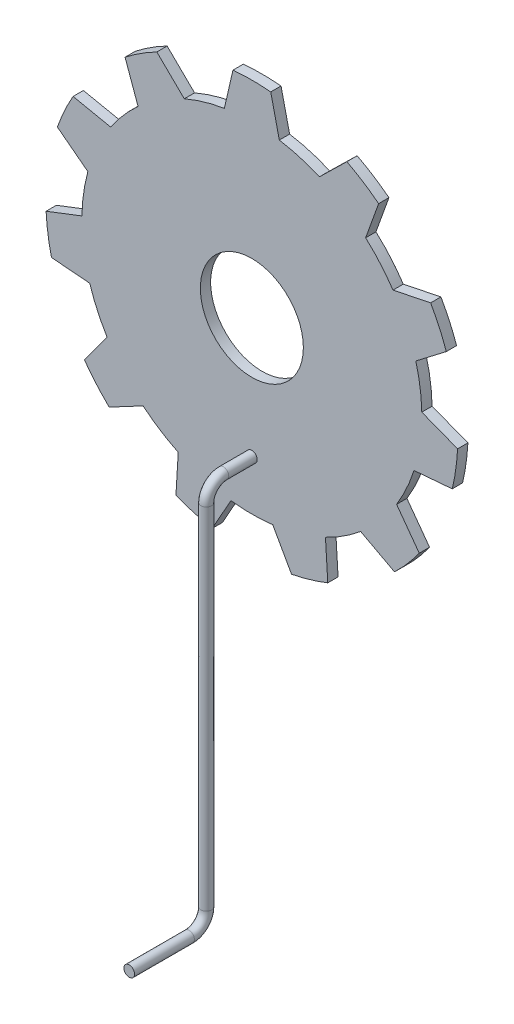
ISO-10303-21;
HEADER;
FILE_DESCRIPTION(('STEP AP214'),'2;1');
FILE_NAME('part.step','',(''),(''),'','','');
FILE_SCHEMA(('AUTOMOTIVE_DESIGN { 1 0 10303 214 1 1 1 1 }'));
ENDSEC;
DATA;
#1=APPLICATION_CONTEXT('core data for automotive mechanical design processes');
#2=APPLICATION_PROTOCOL_DEFINITION('international standard','automotive_design',2000,#1);
#3=PRODUCT_CONTEXT('',#1,'mechanical');
#4=PRODUCT('Part','Part','',(#3));
#5=PRODUCT_RELATED_PRODUCT_CATEGORY('part','',(#4));
#6=PRODUCT_DEFINITION_FORMATION('','',#4);
#7=PRODUCT_DEFINITION_CONTEXT('part definition',#1,'design');
#8=PRODUCT_DEFINITION('design','',#6,#7);
#9=PRODUCT_DEFINITION_SHAPE('','',#8);
#10=(LENGTH_UNIT() NAMED_UNIT(*) SI_UNIT(.MILLI.,.METRE.));
#11=(NAMED_UNIT(*) PLANE_ANGLE_UNIT() SI_UNIT($,.RADIAN.));
#12=(NAMED_UNIT(*) SI_UNIT($,.STERADIAN.) SOLID_ANGLE_UNIT());
#13=UNCERTAINTY_MEASURE_WITH_UNIT(LENGTH_MEASURE(1.E-05),#10,'distance_accuracy_value','');
#14=(GEOMETRIC_REPRESENTATION_CONTEXT(3) GLOBAL_UNCERTAINTY_ASSIGNED_CONTEXT((#13)) GLOBAL_UNIT_ASSIGNED_CONTEXT((#10,
#11,#12)) REPRESENTATION_CONTEXT('',''));
#15=CARTESIAN_POINT('',(0.,0.,0.));
#16=DIRECTION('',(0.,0.,1.));
#17=DIRECTION('',(1.,0.,0.));
#18=AXIS2_PLACEMENT_3D('',#15,#16,#17);
#19=CARTESIAN_POINT('',(0.,0.,3.));
#20=DIRECTION('',(0.,0.,-1.));
#21=DIRECTION('',(-1.,0.,0.));
#22=AXIS2_PLACEMENT_3D('',#19,#20,#21);
#23=CYLINDRICAL_SURFACE('',#22,49.4999153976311);
#24=CARTESIAN_POINT('',(0.,0.,3.));
#25=DIRECTION('',(0.,0.,1.));
#26=DIRECTION('',(1.,0.,0.));
#27=AXIS2_PLACEMENT_3D('',#24,#25,#26);
#28=CIRCLE('',#27,49.4999153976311);
#29=CARTESIAN_POINT('',(19.6798281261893,45.4196652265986,3.));
#30=VERTEX_POINT('',#29);
#31=CARTESIAN_POINT('',(8.00000000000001,48.8491721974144,3.));
#32=VERTEX_POINT('',#31);
#33=EDGE_CURVE('E45',#30,#32,#28,.T.);
#34=ORIENTED_EDGE('',*,*,#33,.F.);
#35=DIRECTION('',(0.,0.,1.));
#36=VECTOR('',#35,1.);
#37=CARTESIAN_POINT('',(19.6798281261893,45.4196652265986,0.));
#38=LINE('',#37,#36);
#39=CARTESIAN_POINT('',(19.6798281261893,45.4196652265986,0.));
#40=VERTEX_POINT('',#39);
#41=EDGE_CURVE('E348',#40,#30,#38,.T.);
#42=ORIENTED_EDGE('',*,*,#41,.F.);
#43=CARTESIAN_POINT('',(0.,0.,0.));
#44=DIRECTION('',(0.,0.,1.));
#45=DIRECTION('',(1.,0.,0.));
#46=AXIS2_PLACEMENT_3D('',#43,#44,#45);
#47=CIRCLE('',#46,49.4999153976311);
#48=CARTESIAN_POINT('',(8.00000000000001,48.8491721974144,0.));
#49=VERTEX_POINT('',#48);
#50=EDGE_CURVE('E616',#40,#49,#47,.T.);
#51=ORIENTED_EDGE('',*,*,#50,.T.);
#52=DIRECTION('',(0.,0.,1.));
#53=VECTOR('',#52,1.);
#54=CARTESIAN_POINT('',(8.,48.8491721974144,0.));
#55=LINE('',#54,#53);
#56=EDGE_CURVE('E612',#49,#32,#55,.T.);
#57=ORIENTED_EDGE('',*,*,#56,.T.);
#58=EDGE_LOOP('',(#34,#42,#51,#57));
#59=FACE_BOUND('',#58,.T.);
#60=ADVANCED_FACE('F28',(#59),#23,.T.);
#61=CARTESIAN_POINT('',(41.1114498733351,27.5697354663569,0.));
#62=VERTEX_POINT('',#61);
#63=CARTESIAN_POINT('',(33.1398846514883,36.7694121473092,0.));
#64=VERTEX_POINT('',#63);
#65=EDGE_CURVE('E763',#62,#64,#47,.T.);
#66=ORIENTED_EDGE('',*,*,#65,.T.);
#67=DIRECTION('',(0.,0.,1.));
#68=VECTOR('',#67,1.);
#69=CARTESIAN_POINT('',(33.1398846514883,36.7694121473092,0.));
#70=LINE('',#69,#68);
#71=CARTESIAN_POINT('',(33.1398846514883,36.7694121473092,3.));
#72=VERTEX_POINT('',#71);
#73=EDGE_CURVE('E53',#64,#72,#70,.T.);
#74=ORIENTED_EDGE('',*,*,#73,.T.);
#75=CARTESIAN_POINT('',(41.1114498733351,27.5697354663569,3.));
#76=VERTEX_POINT('',#75);
#77=EDGE_CURVE('E335',#76,#72,#28,.T.);
#78=ORIENTED_EDGE('',*,*,#77,.F.);
#79=DIRECTION('',(0.,0.,1.));
#80=VECTOR('',#79,1.);
#81=CARTESIAN_POINT('',(41.1114498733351,27.5697354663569,0.));
#82=LINE('',#81,#80);
#83=EDGE_CURVE('E370',#62,#76,#82,.T.);
#84=ORIENTED_EDGE('',*,*,#83,.F.);
#85=EDGE_LOOP('',(#66,#74,#78,#84));
#86=FACE_BOUND('',#85,.T.);
#87=ADVANCED_FACE('F762',(#86),#23,.T.);
#88=CARTESIAN_POINT('',(49.4904767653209,0.966609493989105,0.));
#89=VERTEX_POINT('',#88);
#90=CARTESIAN_POINT('',(47.7580900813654,13.0156235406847,0.));
#91=VERTEX_POINT('',#90);
#92=EDGE_CURVE('E748',#89,#91,#47,.T.);
#93=ORIENTED_EDGE('',*,*,#92,.T.);
#94=DIRECTION('',(0.,0.,1.));
#95=VECTOR('',#94,1.);
#96=CARTESIAN_POINT('',(47.7580900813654,13.0156235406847,0.));
#97=LINE('',#96,#95);
#98=CARTESIAN_POINT('',(47.7580900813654,13.0156235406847,3.));
#99=VERTEX_POINT('',#98);
#100=EDGE_CURVE('E369',#91,#99,#97,.T.);
#101=ORIENTED_EDGE('',*,*,#100,.T.);
#102=CARTESIAN_POINT('',(49.4904767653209,0.96660949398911,3.));
#103=VERTEX_POINT('',#102);
#104=EDGE_CURVE('E628',#103,#99,#28,.T.);
#105=ORIENTED_EDGE('',*,*,#104,.F.);
#106=DIRECTION('',(0.,0.,1.));
#107=VECTOR('',#106,1.);
#108=CARTESIAN_POINT('',(49.4904767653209,0.966609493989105,0.));
#109=LINE('',#108,#107);
#110=EDGE_CURVE('E397',#89,#103,#109,.T.);
#111=ORIENTED_EDGE('',*,*,#110,.F.);
#112=EDGE_LOOP('',(#93,#101,#105,#111));
#113=FACE_BOUND('',#112,.T.);
#114=ADVANCED_FACE('F747',(#113),#23,.T.);
#115=CARTESIAN_POINT('',(42.1566269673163,-25.9434081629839,0.));
#116=VERTEX_POINT('',#115);
#117=CARTESIAN_POINT('',(47.2134393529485,-14.8705335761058,0.));
#118=VERTEX_POINT('',#117);
#119=EDGE_CURVE('E732',#116,#118,#47,.T.);
#120=ORIENTED_EDGE('',*,*,#119,.T.);
#121=DIRECTION('',(0.,0.,1.));
#122=VECTOR('',#121,1.);
#123=CARTESIAN_POINT('',(47.2134393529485,-14.8705335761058,0.));
#124=LINE('',#123,#122);
#125=CARTESIAN_POINT('',(47.2134393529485,-14.8705335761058,3.));
#126=VERTEX_POINT('',#125);
#127=EDGE_CURVE('E396',#118,#126,#124,.T.);
#128=ORIENTED_EDGE('',*,*,#127,.T.);
#129=CARTESIAN_POINT('',(42.1566269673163,-25.9434081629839,3.));
#130=VERTEX_POINT('',#129);
#131=EDGE_CURVE('E630',#130,#126,#28,.T.);
#132=ORIENTED_EDGE('',*,*,#131,.F.);
#133=DIRECTION('',(0.,0.,1.));
#134=VECTOR('',#133,1.);
#135=CARTESIAN_POINT('',(42.1566269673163,-25.9434081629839,0.));
#136=LINE('',#135,#134);
#137=EDGE_CURVE('E424',#116,#130,#136,.T.);
#138=ORIENTED_EDGE('',*,*,#137,.F.);
#139=EDGE_LOOP('',(#120,#128,#132,#138));
#140=FACE_BOUND('',#139,.T.);
#141=ADVANCED_FACE('F731',(#140),#23,.T.);
#142=CARTESIAN_POINT('',(21.4383459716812,-44.6165770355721,0.));
#143=VERTEX_POINT('',#142);
#144=CARTESIAN_POINT('',(31.6788552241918,-38.0354013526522,0.));
#145=VERTEX_POINT('',#144);
#146=EDGE_CURVE('E716',#143,#145,#47,.T.);
#147=ORIENTED_EDGE('',*,*,#146,.T.);
#148=DIRECTION('',(0.,0.,1.));
#149=VECTOR('',#148,1.);
#150=CARTESIAN_POINT('',(31.6788552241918,-38.0354013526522,0.));
#151=LINE('',#150,#149);
#152=CARTESIAN_POINT('',(31.6788552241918,-38.0354013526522,3.));
#153=VERTEX_POINT('',#152);
#154=EDGE_CURVE('E423',#145,#153,#151,.T.);
#155=ORIENTED_EDGE('',*,*,#154,.T.);
#156=CARTESIAN_POINT('',(21.4383459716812,-44.6165770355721,3.));
#157=VERTEX_POINT('',#156);
#158=EDGE_CURVE('E633',#157,#153,#28,.T.);
#159=ORIENTED_EDGE('',*,*,#158,.F.);
#160=DIRECTION('',(0.,0.,1.));
#161=VECTOR('',#160,1.);
#162=CARTESIAN_POINT('',(21.4383459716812,-44.6165770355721,0.));
#163=LINE('',#162,#161);
#164=EDGE_CURVE('E451',#143,#157,#163,.T.);
#165=ORIENTED_EDGE('',*,*,#164,.F.);
#166=EDGE_LOOP('',(#147,#155,#159,#165));
#167=FACE_BOUND('',#166,.T.);
#168=ADVANCED_FACE('F715',(#167),#23,.T.);
#169=CARTESIAN_POINT('',(-6.08645839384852,-49.1242979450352,0.));
#170=VERTEX_POINT('',#169);
#171=CARTESIAN_POINT('',(6.08645839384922,-49.1242979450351,0.));
#172=VERTEX_POINT('',#171);
#173=EDGE_CURVE('E700',#170,#172,#47,.T.);
#174=ORIENTED_EDGE('',*,*,#173,.T.);
#175=DIRECTION('',(0.,0.,1.));
#176=VECTOR('',#175,1.);
#177=CARTESIAN_POINT('',(6.08645839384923,-49.1242979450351,0.));
#178=LINE('',#177,#176);
#179=CARTESIAN_POINT('',(6.08645839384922,-49.1242979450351,3.));
#180=VERTEX_POINT('',#179);
#181=EDGE_CURVE('E450',#172,#180,#178,.T.);
#182=ORIENTED_EDGE('',*,*,#181,.T.);
#183=CARTESIAN_POINT('',(-6.08645839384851,-49.1242979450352,3.));
#184=VERTEX_POINT('',#183);
#185=EDGE_CURVE('E636',#184,#180,#28,.T.);
#186=ORIENTED_EDGE('',*,*,#185,.F.);
#187=DIRECTION('',(0.,0.,1.));
#188=VECTOR('',#187,1.);
#189=CARTESIAN_POINT('',(-6.08645839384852,-49.1242979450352,0.));
#190=LINE('',#189,#188);
#191=EDGE_CURVE('E478',#170,#184,#190,.T.);
#192=ORIENTED_EDGE('',*,*,#191,.F.);
#193=EDGE_LOOP('',(#174,#182,#186,#192));
#194=FACE_BOUND('',#193,.T.);
#195=ADVANCED_FACE('F699',(#194),#23,.T.);
#196=CARTESIAN_POINT('',(-31.6788552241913,-38.0354013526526,0.));
#197=VERTEX_POINT('',#196);
#198=CARTESIAN_POINT('',(-21.4383459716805,-44.6165770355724,0.));
#199=VERTEX_POINT('',#198);
#200=EDGE_CURVE('E684',#197,#199,#47,.T.);
#201=ORIENTED_EDGE('',*,*,#200,.T.);
#202=DIRECTION('',(0.,0.,1.));
#203=VECTOR('',#202,1.);
#204=CARTESIAN_POINT('',(-21.4383459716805,-44.6165770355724,0.));
#205=LINE('',#204,#203);
#206=CARTESIAN_POINT('',(-21.4383459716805,-44.6165770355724,3.));
#207=VERTEX_POINT('',#206);
#208=EDGE_CURVE('E477',#199,#207,#205,.T.);
#209=ORIENTED_EDGE('',*,*,#208,.T.);
#210=CARTESIAN_POINT('',(-31.6788552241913,-38.0354013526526,3.));
#211=VERTEX_POINT('',#210);
#212=EDGE_CURVE('E639',#211,#207,#28,.T.);
#213=ORIENTED_EDGE('',*,*,#212,.F.);
#214=DIRECTION('',(0.,0.,1.));
#215=VECTOR('',#214,1.);
#216=CARTESIAN_POINT('',(-31.6788552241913,-38.0354013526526,0.));
#217=LINE('',#216,#215);
#218=EDGE_CURVE('E505',#197,#211,#217,.T.);
#219=ORIENTED_EDGE('',*,*,#218,.F.);
#220=EDGE_LOOP('',(#201,#209,#213,#219));
#221=FACE_BOUND('',#220,.T.);
#222=ADVANCED_FACE('F683',(#221),#23,.T.);
#223=CARTESIAN_POINT('',(-47.2134393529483,-14.8705335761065,0.));
#224=VERTEX_POINT('',#223);
#225=CARTESIAN_POINT('',(-42.1566269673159,-25.9434081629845,0.));
#226=VERTEX_POINT('',#225);
#227=EDGE_CURVE('E666',#224,#226,#47,.T.);
#228=ORIENTED_EDGE('',*,*,#227,.T.);
#229=DIRECTION('',(0.,0.,1.));
#230=VECTOR('',#229,1.);
#231=CARTESIAN_POINT('',(-42.1566269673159,-25.9434081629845,0.));
#232=LINE('',#231,#230);
#233=CARTESIAN_POINT('',(-42.1566269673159,-25.9434081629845,3.));
#234=VERTEX_POINT('',#233);
#235=EDGE_CURVE('E504',#226,#234,#232,.T.);
#236=ORIENTED_EDGE('',*,*,#235,.T.);
#237=CARTESIAN_POINT('',(-47.2134393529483,-14.8705335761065,3.));
#238=VERTEX_POINT('',#237);
#239=EDGE_CURVE('E642',#238,#234,#28,.T.);
#240=ORIENTED_EDGE('',*,*,#239,.F.);
#241=DIRECTION('',(0.,0.,1.));
#242=VECTOR('',#241,1.);
#243=CARTESIAN_POINT('',(-47.2134393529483,-14.8705335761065,0.));
#244=LINE('',#243,#242);
#245=EDGE_CURVE('E532',#224,#238,#244,.T.);
#246=ORIENTED_EDGE('',*,*,#245,.F.);
#247=EDGE_LOOP('',(#228,#236,#240,#246));
#248=FACE_BOUND('',#247,.T.);
#249=ADVANCED_FACE('F665',(#248),#23,.T.);
#250=CARTESIAN_POINT('',(-47.7580900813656,13.015623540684,0.));
#251=VERTEX_POINT('',#250);
#252=CARTESIAN_POINT('',(-49.4904767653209,0.966609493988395,0.));
#253=VERTEX_POINT('',#252);
#254=EDGE_CURVE('E810',#251,#253,#47,.T.);
#255=ORIENTED_EDGE('',*,*,#254,.T.);
#256=DIRECTION('',(0.,0.,1.));
#257=VECTOR('',#256,1.);
#258=CARTESIAN_POINT('',(-49.4904767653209,0.96660949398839,0.));
#259=LINE('',#258,#257);
#260=CARTESIAN_POINT('',(-49.4904767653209,0.966609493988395,3.));
#261=VERTEX_POINT('',#260);
#262=EDGE_CURVE('E531',#253,#261,#259,.T.);
#263=ORIENTED_EDGE('',*,*,#262,.T.);
#264=CARTESIAN_POINT('',(-47.7580900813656,13.015623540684,3.));
#265=VERTEX_POINT('',#264);
#266=EDGE_CURVE('E627',#265,#261,#28,.T.);
#267=ORIENTED_EDGE('',*,*,#266,.F.);
#268=DIRECTION('',(0.,0.,1.));
#269=VECTOR('',#268,1.);
#270=CARTESIAN_POINT('',(-47.7580900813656,13.015623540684,0.));
#271=LINE('',#270,#269);
#272=EDGE_CURVE('E559',#251,#265,#271,.T.);
#273=ORIENTED_EDGE('',*,*,#272,.F.);
#274=EDGE_LOOP('',(#255,#263,#267,#273));
#275=FACE_BOUND('',#274,.T.);
#276=ADVANCED_FACE('F809',(#275),#23,.T.);
#277=CARTESIAN_POINT('',(-33.1398846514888,36.7694121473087,0.));
#278=VERTEX_POINT('',#277);
#279=CARTESIAN_POINT('',(-41.1114498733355,27.5697354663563,0.));
#280=VERTEX_POINT('',#279);
#281=EDGE_CURVE('E623',#278,#280,#47,.T.);
#282=ORIENTED_EDGE('',*,*,#281,.T.);
#283=DIRECTION('',(0.,0.,1.));
#284=VECTOR('',#283,1.);
#285=CARTESIAN_POINT('',(-41.1114498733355,27.5697354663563,0.));
#286=LINE('',#285,#284);
#287=CARTESIAN_POINT('',(-41.1114498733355,27.5697354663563,3.));
#288=VERTEX_POINT('',#287);
#289=EDGE_CURVE('E558',#280,#288,#286,.T.);
#290=ORIENTED_EDGE('',*,*,#289,.T.);
#291=CARTESIAN_POINT('',(-33.1398846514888,36.7694121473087,3.));
#292=VERTEX_POINT('',#291);
#293=EDGE_CURVE('E624',#292,#288,#28,.T.);
#294=ORIENTED_EDGE('',*,*,#293,.F.);
#295=DIRECTION('',(0.,0.,1.));
#296=VECTOR('',#295,1.);
#297=CARTESIAN_POINT('',(-33.1398846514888,36.7694121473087,0.));
#298=LINE('',#297,#296);
#299=EDGE_CURVE('E586',#278,#292,#298,.T.);
#300=ORIENTED_EDGE('',*,*,#299,.F.);
#301=EDGE_LOOP('',(#282,#290,#294,#300));
#302=FACE_BOUND('',#301,.T.);
#303=ADVANCED_FACE('F796',(#302),#23,.T.);
#304=CARTESIAN_POINT('',(-8.,48.8491721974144,0.));
#305=VERTEX_POINT('',#304);
#306=CARTESIAN_POINT('',(-19.6798281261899,45.4196652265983,0.));
#307=VERTEX_POINT('',#306);
#308=EDGE_CURVE('E622',#305,#307,#47,.T.);
#309=ORIENTED_EDGE('',*,*,#308,.T.);
#310=DIRECTION('',(0.,0.,1.));
#311=VECTOR('',#310,1.);
#312=CARTESIAN_POINT('',(-19.67982812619,45.4196652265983,0.));
#313=LINE('',#312,#311);
#314=CARTESIAN_POINT('',(-19.6798281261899,45.4196652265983,3.));
#315=VERTEX_POINT('',#314);
#316=EDGE_CURVE('E585',#307,#315,#313,.T.);
#317=ORIENTED_EDGE('',*,*,#316,.T.);
#318=CARTESIAN_POINT('',(-8.00000000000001,48.8491721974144,3.));
#319=VERTEX_POINT('',#318);
#320=EDGE_CURVE('E37',#319,#315,#28,.T.);
#321=ORIENTED_EDGE('',*,*,#320,.F.);
#322=DIRECTION('',(0.,0.,1.));
#323=VECTOR('',#322,1.);
#324=CARTESIAN_POINT('',(-8.,48.8491721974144,0.));
#325=LINE('',#324,#323);
#326=EDGE_CURVE('E613',#305,#319,#325,.T.);
#327=ORIENTED_EDGE('',*,*,#326,.F.);
#328=EDGE_LOOP('',(#309,#317,#321,#327));
#329=FACE_BOUND('',#328,.T.);
#330=ADVANCED_FACE('F30',(#329),#23,.T.);
#331=CARTESIAN_POINT('',(0.,0.,3.));
#332=DIRECTION('',(0.,0.,1.));
#333=DIRECTION('',(1.,0.,0.));
#334=AXIS2_PLACEMENT_3D('',#331,#332,#333);
#335=PLANE('',#334);
#336=CARTESIAN_POINT('',(0.,-34.9695936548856,3.));
#337=DIRECTION('',(0.,0.,1.));
#338=DIRECTION('',(1.,0.,0.));
#339=AXIS2_PLACEMENT_3D('',#336,#337,#338);
#340=CIRCLE('',#339,1.56075635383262);
#341=CARTESIAN_POINT('',(1.56075635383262,-34.9695936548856,3.));
#342=VERTEX_POINT('',#341);
#343=EDGE_CURVE('E11',#342,#342,#340,.T.);
#344=ORIENTED_EDGE('',*,*,#343,.F.);
#345=EDGE_LOOP('',(#344));
#346=FACE_BOUND('',#345,.T.);
#347=CARTESIAN_POINT('',(0.,0.,3.));
#348=DIRECTION('',(0.,0.,1.));
#349=DIRECTION('',(1.,0.,0.));
#350=AXIS2_PLACEMENT_3D('',#347,#348,#349);
#351=CIRCLE('',#350,15.);
#352=CARTESIAN_POINT('',(15.,0.,3.));
#353=VERTEX_POINT('',#352);
#354=EDGE_CURVE('E338',#353,#353,#351,.T.);
#355=ORIENTED_EDGE('',*,*,#354,.F.);
#356=EDGE_LOOP('',(#355));
#357=FACE_BOUND('',#356,.T.);
#358=ORIENTED_EDGE('',*,*,#320,.T.);
#359=DIRECTION('',(-0.715047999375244,0.699075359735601,0.));
#360=VECTOR('',#359,1.);
#361=CARTESIAN_POINT('',(-19.67982812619,45.4196652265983,3.));
#362=LINE('',#361,#360);
#363=CARTESIAN_POINT('',(-27.6749805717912,53.2362231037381,3.));
#364=VERTEX_POINT('',#363);
#365=EDGE_CURVE('E562',#315,#364,#362,.T.);
#366=ORIENTED_EDGE('',*,*,#365,.T.);
#367=CARTESIAN_POINT('',(0.,0.,3.));
#368=DIRECTION('',(0.,0.,1.));
#369=DIRECTION('',(0.84125353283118,0.540640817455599,0.));
#370=AXIS2_PLACEMENT_3D('',#367,#368,#369);
#371=CIRCLE('',#370,60.);
#372=CARTESIAN_POINT('',(-36.9287694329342,47.2891741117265,3.));
#373=VERTEX_POINT('',#372);
#374=EDGE_CURVE('E570',#364,#373,#371,.T.);
#375=ORIENTED_EDGE('',*,*,#374,.T.);
#376=DIRECTION('',(0.338859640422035,-0.940836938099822,0.));
#377=VECTOR('',#376,1.);
#378=CARTESIAN_POINT('',(-33.1398846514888,36.7694121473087,3.));
#379=LINE('',#378,#377);
#380=EDGE_CURVE('E573',#373,#292,#379,.T.);
#381=ORIENTED_EDGE('',*,*,#380,.T.);
#382=ORIENTED_EDGE('',*,*,#293,.T.);
#383=DIRECTION('',(-0.979485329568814,0.20151548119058,0.));
#384=VECTOR('',#383,1.);
#385=CARTESIAN_POINT('',(-41.1114498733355,27.5697354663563,3.));
#386=LINE('',#385,#384);
#387=CARTESIAN_POINT('',(-52.0633503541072,29.8229366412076,3.));
#388=VERTEX_POINT('',#387);
#389=EDGE_CURVE('E535',#288,#388,#386,.T.);
#390=ORIENTED_EDGE('',*,*,#389,.T.);
#391=CARTESIAN_POINT('',(0.,0.,3.));
#392=DIRECTION('',(0.,0.,1.));
#393=DIRECTION('',(0.415415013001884,0.909631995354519,0.));
#394=AXIS2_PLACEMENT_3D('',#391,#392,#393);
#395=CIRCLE('',#394,60.);
#396=CARTESIAN_POINT('',(-56.6329154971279,19.8169846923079,3.));
#397=VERTEX_POINT('',#396);
#398=EDGE_CURVE('E543',#388,#397,#395,.T.);
#399=ORIENTED_EDGE('',*,*,#398,.T.);
#400=DIRECTION('',(0.793721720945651,-0.608281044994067,0.));
#401=VECTOR('',#400,1.);
#402=CARTESIAN_POINT('',(-47.7580900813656,13.015623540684,3.));
#403=LINE('',#402,#401);
#404=EDGE_CURVE('E546',#397,#265,#403,.T.);
#405=ORIENTED_EDGE('',*,*,#404,.T.);
#406=ORIENTED_EDGE('',*,*,#266,.T.);
#407=DIRECTION('',(-0.932942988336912,-0.360024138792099,0.));
#408=VECTOR('',#407,1.);
#409=CARTESIAN_POINT('',(-49.4904767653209,0.96660949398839,3.));
#410=LINE('',#409,#408);
#411=CARTESIAN_POINT('',(-59.9219742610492,-3.05892148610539,3.));
#412=VERTEX_POINT('',#411);
#413=EDGE_CURVE('E508',#261,#412,#410,.T.);
#414=ORIENTED_EDGE('',*,*,#413,.T.);
#415=CARTESIAN_POINT('',(0.,0.,3.));
#416=DIRECTION('',(0.,0.,1.));
#417=DIRECTION('',(-0.142314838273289,0.989821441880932,0.));
#418=AXIS2_PLACEMENT_3D('',#415,#416,#417);
#419=CIRCLE('',#418,60.);
#420=CARTESIAN_POINT('',(-58.356511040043,-13.9469573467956,3.));
#421=VERTEX_POINT('',#420);
#422=EDGE_CURVE('E516',#412,#421,#419,.T.);
#423=ORIENTED_EDGE('',*,*,#422,.T.);
#424=DIRECTION('',(0.996582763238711,-0.0826002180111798,0.));
#425=VECTOR('',#424,1.);
#426=CARTESIAN_POINT('',(-47.2134393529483,-14.8705335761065,3.));
#427=LINE('',#426,#425);
#428=EDGE_CURVE('E519',#421,#238,#427,.T.);
#429=ORIENTED_EDGE('',*,*,#428,.T.);
#430=ORIENTED_EDGE('',*,*,#239,.T.);
#431=DIRECTION('',(-0.590197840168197,-0.807258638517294,0.));
#432=VECTOR('',#431,1.);
#433=CARTESIAN_POINT('',(-42.1566269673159,-25.9434081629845,3.));
#434=LINE('',#433,#432);
#435=CARTESIAN_POINT('',(-48.7557947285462,-34.9695936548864,3.));
#436=VERTEX_POINT('',#435);
#437=EDGE_CURVE('E481',#234,#436,#434,.T.);
#438=ORIENTED_EDGE('',*,*,#437,.T.);
#439=CARTESIAN_POINT('',(0.,0.,3.));
#440=DIRECTION('',(0.,0.,1.));
#441=DIRECTION('',(-0.654860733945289,0.755749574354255,0.));
#442=AXIS2_PLACEMENT_3D('',#439,#440,#441);
#443=CIRCLE('',#442,60.);
#444=CARTESIAN_POINT('',(-41.552326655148,-43.2828389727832,3.));
#445=VERTEX_POINT('',#444);
#446=EDGE_CURVE('E489',#436,#445,#443,.T.);
#447=ORIENTED_EDGE('',*,*,#446,.T.);
#448=DIRECTION('',(0.883035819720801,0.469305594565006,0.));
#449=VECTOR('',#448,1.);
#450=CARTESIAN_POINT('',(-31.6788552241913,-38.0354013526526,3.));
#451=LINE('',#450,#449);
#452=EDGE_CURVE('E492',#445,#211,#451,.T.);
#453=ORIENTED_EDGE('',*,*,#452,.T.);
#454=ORIENTED_EDGE('',*,*,#212,.T.);
#455=DIRECTION('',(-0.0600690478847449,-0.998194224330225,0.));
#456=VECTOR('',#455,1.);
#457=CARTESIAN_POINT('',(-21.4383459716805,-44.6165770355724,3.));
#458=LINE('',#457,#456);
#459=CARTESIAN_POINT('',(-22.1099948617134,-55.7776669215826,3.));
#460=VERTEX_POINT('',#459);
#461=EDGE_CURVE('E454',#207,#460,#458,.T.);
#462=ORIENTED_EDGE('',*,*,#461,.T.);
#463=CARTESIAN_POINT('',(0.,0.,3.));
#464=DIRECTION('',(0.,0.,1.));
#465=DIRECTION('',(-0.959492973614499,0.281732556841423,0.));
#466=AXIS2_PLACEMENT_3D('',#463,#464,#465);
#467=CIRCLE('',#466,60.);
#468=CARTESIAN_POINT('',(-11.555572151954,-58.8767250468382,3.));
#469=VERTEX_POINT('',#468);
#470=EDGE_CURVE('E462',#460,#469,#467,.T.);
#471=ORIENTED_EDGE('',*,*,#470,.T.);
#472=DIRECTION('',(0.48913124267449,0.872210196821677,0.));
#473=VECTOR('',#472,1.);
#474=CARTESIAN_POINT('',(-6.08645839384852,-49.1242979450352,3.));
#475=LINE('',#474,#473);
#476=EDGE_CURVE('E465',#469,#184,#475,.T.);
#477=ORIENTED_EDGE('',*,*,#476,.T.);
#478=ORIENTED_EDGE('',*,*,#185,.T.);
#479=DIRECTION('',(0.489131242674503,-0.87221019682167,0.));
#480=VECTOR('',#479,1.);
#481=CARTESIAN_POINT('',(6.08645839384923,-49.1242979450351,3.));
#482=LINE('',#481,#480);
#483=CARTESIAN_POINT('',(11.5555721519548,-58.876725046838,3.));
#484=VERTEX_POINT('',#483);
#485=EDGE_CURVE('E427',#180,#484,#482,.T.);
#486=ORIENTED_EDGE('',*,*,#485,.T.);
#487=CARTESIAN_POINT('',(0.,0.,3.));
#488=DIRECTION('',(0.,0.,1.));
#489=DIRECTION('',(-0.959492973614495,-0.281732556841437,0.));
#490=AXIS2_PLACEMENT_3D('',#487,#488,#489);
#491=CIRCLE('',#490,60.);
#492=CARTESIAN_POINT('',(22.1099948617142,-55.7776669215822,3.));
#493=VERTEX_POINT('',#492);
#494=EDGE_CURVE('E435',#484,#493,#491,.T.);
#495=ORIENTED_EDGE('',*,*,#494,.T.);
#496=DIRECTION('',(-0.0600690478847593,0.998194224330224,0.));
#497=VECTOR('',#496,1.);
#498=CARTESIAN_POINT('',(21.4383459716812,-44.6165770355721,3.));
#499=LINE('',#498,#497);
#500=EDGE_CURVE('E438',#493,#157,#499,.T.);
#501=ORIENTED_EDGE('',*,*,#500,.T.);
#502=ORIENTED_EDGE('',*,*,#158,.T.);
#503=DIRECTION('',(0.883035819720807,-0.469305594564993,0.));
#504=VECTOR('',#503,1.);
#505=CARTESIAN_POINT('',(31.6788552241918,-38.0354013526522,3.));
#506=LINE('',#505,#504);
#507=CARTESIAN_POINT('',(41.5523266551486,-43.2828389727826,3.));
#508=VERTEX_POINT('',#507);
#509=EDGE_CURVE('E400',#153,#508,#506,.T.);
#510=ORIENTED_EDGE('',*,*,#509,.T.);
#511=CARTESIAN_POINT('',(0.,0.,3.));
#512=DIRECTION('',(0.,0.,1.));
#513=DIRECTION('',(-0.654860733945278,-0.755749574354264,0.));
#514=AXIS2_PLACEMENT_3D('',#511,#512,#513);
#515=CIRCLE('',#514,60.);
#516=CARTESIAN_POINT('',(48.7557947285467,-34.9695936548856,3.));
#517=VERTEX_POINT('',#516);
#518=EDGE_CURVE('E408',#508,#517,#515,.T.);
#519=ORIENTED_EDGE('',*,*,#518,.T.);
#520=DIRECTION('',(-0.590197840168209,0.807258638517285,0.));
#521=VECTOR('',#520,1.);
#522=CARTESIAN_POINT('',(42.1566269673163,-25.9434081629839,3.));
#523=LINE('',#522,#521);
#524=EDGE_CURVE('E411',#517,#130,#523,.T.);
#525=ORIENTED_EDGE('',*,*,#524,.T.);
#526=ORIENTED_EDGE('',*,*,#131,.T.);
#527=DIRECTION('',(0.99658276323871,0.0826002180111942,0.));
#528=VECTOR('',#527,1.);
#529=CARTESIAN_POINT('',(47.2134393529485,-14.8705335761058,3.));
#530=LINE('',#529,#528);
#531=CARTESIAN_POINT('',(58.3565110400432,-13.9469573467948,3.));
#532=VERTEX_POINT('',#531);
#533=EDGE_CURVE('E373',#126,#532,#530,.T.);
#534=ORIENTED_EDGE('',*,*,#533,.T.);
#535=CARTESIAN_POINT('',(0.,0.,3.));
#536=DIRECTION('',(0.,0.,1.));
#537=DIRECTION('',(-0.142314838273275,-0.989821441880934,0.));
#538=AXIS2_PLACEMENT_3D('',#535,#536,#537);
#539=CIRCLE('',#538,60.);
#540=CARTESIAN_POINT('',(59.9219742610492,-3.05892148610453,3.));
#541=VERTEX_POINT('',#540);
#542=EDGE_CURVE('E381',#532,#541,#539,.T.);
#543=ORIENTED_EDGE('',*,*,#542,.T.);
#544=DIRECTION('',(-0.932942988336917,0.360024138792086,0.));
#545=VECTOR('',#544,1.);
#546=CARTESIAN_POINT('',(49.4904767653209,0.966609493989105,3.));
#547=LINE('',#546,#545);
#548=EDGE_CURVE('E384',#541,#103,#547,.T.);
#549=ORIENTED_EDGE('',*,*,#548,.T.);
#550=ORIENTED_EDGE('',*,*,#104,.T.);
#551=DIRECTION('',(0.793721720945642,0.608281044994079,0.));
#552=VECTOR('',#551,1.);
#553=CARTESIAN_POINT('',(47.7580900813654,13.0156235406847,3.));
#554=LINE('',#553,#552);
#555=CARTESIAN_POINT('',(56.6329154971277,19.8169846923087,3.));
#556=VERTEX_POINT('',#555);
#557=EDGE_CURVE('E350',#99,#556,#554,.T.);
#558=ORIENTED_EDGE('',*,*,#557,.T.);
#559=CARTESIAN_POINT('',(0.,0.,3.));
#560=DIRECTION('',(0.,0.,1.));
#561=DIRECTION('',(0.415415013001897,-0.909631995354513,0.));
#562=AXIS2_PLACEMENT_3D('',#559,#560,#561);
#563=CIRCLE('',#562,60.);
#564=CARTESIAN_POINT('',(52.0633503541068,29.8229366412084,3.));
#565=VERTEX_POINT('',#564);
#566=EDGE_CURVE('E355',#556,#565,#563,.T.);
#567=ORIENTED_EDGE('',*,*,#566,.T.);
#568=DIRECTION('',(-0.979485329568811,-0.201515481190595,0.));
#569=VECTOR('',#568,1.);
#570=CARTESIAN_POINT('',(41.1114498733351,27.5697354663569,3.));
#571=LINE('',#570,#569);
#572=EDGE_CURVE('E358',#565,#76,#571,.T.);
#573=ORIENTED_EDGE('',*,*,#572,.T.);
#574=ORIENTED_EDGE('',*,*,#77,.T.);
#575=DIRECTION('',(0.338859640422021,0.940836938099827,0.));
#576=VECTOR('',#575,1.);
#577=CARTESIAN_POINT('',(33.1398846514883,36.7694121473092,3.));
#578=LINE('',#577,#576);
#579=CARTESIAN_POINT('',(36.9287694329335,47.2891741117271,3.));
#580=VERTEX_POINT('',#579);
#581=EDGE_CURVE('E316',#72,#580,#578,.T.);
#582=ORIENTED_EDGE('',*,*,#581,.T.);
#583=CARTESIAN_POINT('',(0.,0.,3.));
#584=DIRECTION('',(0.,0.,1.));
#585=DIRECTION('',(0.841253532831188,-0.540640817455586,0.));
#586=AXIS2_PLACEMENT_3D('',#583,#584,#585);
#587=CIRCLE('',#586,60.);
#588=CARTESIAN_POINT('',(27.6749805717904,53.2362231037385,3.));
#589=VERTEX_POINT('',#588);
#590=EDGE_CURVE('E325',#580,#589,#587,.T.);
#591=ORIENTED_EDGE('',*,*,#590,.T.);
#592=DIRECTION('',(-0.715047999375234,-0.699075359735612,0.));
#593=VECTOR('',#592,1.);
#594=CARTESIAN_POINT('',(19.6798281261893,45.4196652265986,3.));
#595=LINE('',#594,#593);
#596=EDGE_CURVE('E330',#589,#30,#595,.T.);
#597=ORIENTED_EDGE('',*,*,#596,.T.);
#598=ORIENTED_EDGE('',*,*,#33,.T.);
#599=DIRECTION('',(-0.22358798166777,0.974683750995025,0.));
#600=VECTOR('',#599,1.);
#601=CARTESIAN_POINT('',(8.,48.8491721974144,3.));
#602=LINE('',#601,#600);
#603=CARTESIAN_POINT('',(5.5,59.7473848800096,3.));
#604=VERTEX_POINT('',#603);
#605=EDGE_CURVE('E589',#32,#604,#602,.T.);
#606=ORIENTED_EDGE('',*,*,#605,.T.);
#607=CARTESIAN_POINT('',(0.,0.,3.));
#608=DIRECTION('',(0.,0.,1.));
#609=DIRECTION('',(1.,0.,0.));
#610=AXIS2_PLACEMENT_3D('',#607,#608,#609);
#611=CIRCLE('',#610,60.);
#612=CARTESIAN_POINT('',(-5.5,59.7473848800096,3.));
#613=VERTEX_POINT('',#612);
#614=EDGE_CURVE('E597',#604,#613,#611,.T.);
#615=ORIENTED_EDGE('',*,*,#614,.T.);
#616=DIRECTION('',(-0.22358798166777,-0.974683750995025,0.));
#617=VECTOR('',#616,1.);
#618=CARTESIAN_POINT('',(-8.,48.8491721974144,3.));
#619=LINE('',#618,#617);
#620=EDGE_CURVE('E600',#613,#319,#619,.T.);
#621=ORIENTED_EDGE('',*,*,#620,.T.);
#622=EDGE_LOOP('',(#358,#366,#375,#381,#382,#390,#399,#405,#406,#414,#423,#429,#430,#438,#447,
#453,#454,#462,#471,#477,#478,#486,#495,#501,#502,#510,#519,#525,#526,#534,#543,#549,#550,#558,
#567,#573,#574,#582,#591,#597,#598,#606,#615,#621));
#623=FACE_BOUND('',#622,.T.);
#624=ADVANCED_FACE('F333',(#346,#357,#623),#335,.T.);
#625=CARTESIAN_POINT('',(0.,0.,0.));
#626=DIRECTION('',(0.,0.,1.));
#627=DIRECTION('',(1.,0.,0.));
#628=AXIS2_PLACEMENT_3D('',#625,#626,#627);
#629=PLANE('',#628);
#630=CARTESIAN_POINT('',(0.,0.,0.));
#631=DIRECTION('',(0.,0.,1.));
#632=DIRECTION('',(1.,0.,0.));
#633=AXIS2_PLACEMENT_3D('',#630,#631,#632);
#634=CIRCLE('',#633,15.);
#635=CARTESIAN_POINT('',(15.,0.,0.));
#636=VERTEX_POINT('',#635);
#637=EDGE_CURVE('E32',#636,#636,#634,.T.);
#638=ORIENTED_EDGE('',*,*,#637,.T.);
#639=EDGE_LOOP('',(#638));
#640=FACE_BOUND('',#639,.T.);
#641=ORIENTED_EDGE('',*,*,#308,.F.);
#642=DIRECTION('',(-0.22358798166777,-0.974683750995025,0.));
#643=VECTOR('',#642,1.);
#644=CARTESIAN_POINT('',(-8.,48.8491721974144,0.));
#645=LINE('',#644,#643);
#646=CARTESIAN_POINT('',(-5.5,59.7473848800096,0.));
#647=VERTEX_POINT('',#646);
#648=EDGE_CURVE('E609',#647,#305,#645,.T.);
#649=ORIENTED_EDGE('',*,*,#648,.F.);
#650=CARTESIAN_POINT('',(0.,0.,0.));
#651=DIRECTION('',(0.,0.,1.));
#652=DIRECTION('',(1.,0.,0.));
#653=AXIS2_PLACEMENT_3D('',#650,#651,#652);
#654=CIRCLE('',#653,60.);
#655=CARTESIAN_POINT('',(5.5,59.7473848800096,0.));
#656=VERTEX_POINT('',#655);
#657=EDGE_CURVE('E606',#656,#647,#654,.T.);
#658=ORIENTED_EDGE('',*,*,#657,.F.);
#659=DIRECTION('',(-0.22358798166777,0.974683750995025,0.));
#660=VECTOR('',#659,1.);
#661=CARTESIAN_POINT('',(8.,48.8491721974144,0.));
#662=LINE('',#661,#660);
#663=EDGE_CURVE('E603',#49,#656,#662,.T.);
#664=ORIENTED_EDGE('',*,*,#663,.F.);
#665=ORIENTED_EDGE('',*,*,#50,.F.);
#666=DIRECTION('',(-0.715047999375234,-0.699075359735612,0.));
#667=VECTOR('',#666,1.);
#668=CARTESIAN_POINT('',(19.6798281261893,45.4196652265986,0.));
#669=LINE('',#668,#667);
#670=CARTESIAN_POINT('',(27.6749805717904,53.2362231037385,0.));
#671=VERTEX_POINT('',#670);
#672=EDGE_CURVE('E345',#671,#40,#669,.T.);
#673=ORIENTED_EDGE('',*,*,#672,.F.);
#674=CARTESIAN_POINT('',(0.,0.,0.));
#675=DIRECTION('',(0.,0.,1.));
#676=DIRECTION('',(0.841253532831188,-0.540640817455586,0.));
#677=AXIS2_PLACEMENT_3D('',#674,#675,#676);
#678=CIRCLE('',#677,60.);
#679=CARTESIAN_POINT('',(36.9287694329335,47.2891741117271,0.));
#680=VERTEX_POINT('',#679);
#681=EDGE_CURVE('E343',#680,#671,#678,.T.);
#682=ORIENTED_EDGE('',*,*,#681,.F.);
#683=DIRECTION('',(0.338859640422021,0.940836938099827,0.));
#684=VECTOR('',#683,1.);
#685=CARTESIAN_POINT('',(33.1398846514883,36.7694121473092,0.));
#686=LINE('',#685,#684);
#687=EDGE_CURVE('E318',#64,#680,#686,.T.);
#688=ORIENTED_EDGE('',*,*,#687,.F.);
#689=ORIENTED_EDGE('',*,*,#65,.F.);
#690=DIRECTION('',(-0.979485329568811,-0.201515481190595,0.));
#691=VECTOR('',#690,1.);
#692=CARTESIAN_POINT('',(41.1114498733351,27.5697354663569,0.));
#693=LINE('',#692,#691);
#694=CARTESIAN_POINT('',(52.0633503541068,29.8229366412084,0.));
#695=VERTEX_POINT('',#694);
#696=EDGE_CURVE('E366',#695,#62,#693,.T.);
#697=ORIENTED_EDGE('',*,*,#696,.F.);
#698=CARTESIAN_POINT('',(0.,0.,0.));
#699=DIRECTION('',(0.,0.,1.));
#700=DIRECTION('',(0.415415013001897,-0.909631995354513,0.));
#701=AXIS2_PLACEMENT_3D('',#698,#699,#700);
#702=CIRCLE('',#701,60.);
#703=CARTESIAN_POINT('',(56.6329154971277,19.8169846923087,0.));
#704=VERTEX_POINT('',#703);
#705=EDGE_CURVE('E363',#704,#695,#702,.T.);
#706=ORIENTED_EDGE('',*,*,#705,.F.);
#707=DIRECTION('',(0.793721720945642,0.608281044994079,0.));
#708=VECTOR('',#707,1.);
#709=CARTESIAN_POINT('',(47.7580900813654,13.0156235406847,0.));
#710=LINE('',#709,#708);
#711=EDGE_CURVE('E360',#91,#704,#710,.T.);
#712=ORIENTED_EDGE('',*,*,#711,.F.);
#713=ORIENTED_EDGE('',*,*,#92,.F.);
#714=DIRECTION('',(-0.932942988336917,0.360024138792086,0.));
#715=VECTOR('',#714,1.);
#716=CARTESIAN_POINT('',(49.4904767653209,0.966609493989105,0.));
#717=LINE('',#716,#715);
#718=CARTESIAN_POINT('',(59.9219742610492,-3.05892148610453,0.));
#719=VERTEX_POINT('',#718);
#720=EDGE_CURVE('E393',#719,#89,#717,.T.);
#721=ORIENTED_EDGE('',*,*,#720,.F.);
#722=CARTESIAN_POINT('',(0.,0.,0.));
#723=DIRECTION('',(0.,0.,1.));
#724=DIRECTION('',(-0.142314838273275,-0.989821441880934,0.));
#725=AXIS2_PLACEMENT_3D('',#722,#723,#724);
#726=CIRCLE('',#725,60.);
#727=CARTESIAN_POINT('',(58.3565110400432,-13.9469573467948,0.));
#728=VERTEX_POINT('',#727);
#729=EDGE_CURVE('E390',#728,#719,#726,.T.);
#730=ORIENTED_EDGE('',*,*,#729,.F.);
#731=DIRECTION('',(0.99658276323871,0.0826002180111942,0.));
#732=VECTOR('',#731,1.);
#733=CARTESIAN_POINT('',(47.2134393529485,-14.8705335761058,0.));
#734=LINE('',#733,#732);
#735=EDGE_CURVE('E387',#118,#728,#734,.T.);
#736=ORIENTED_EDGE('',*,*,#735,.F.);
#737=ORIENTED_EDGE('',*,*,#119,.F.);
#738=DIRECTION('',(-0.590197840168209,0.807258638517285,0.));
#739=VECTOR('',#738,1.);
#740=CARTESIAN_POINT('',(42.1566269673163,-25.9434081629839,0.));
#741=LINE('',#740,#739);
#742=CARTESIAN_POINT('',(48.7557947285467,-34.9695936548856,0.));
#743=VERTEX_POINT('',#742);
#744=EDGE_CURVE('E420',#743,#116,#741,.T.);
#745=ORIENTED_EDGE('',*,*,#744,.F.);
#746=CARTESIAN_POINT('',(0.,0.,0.));
#747=DIRECTION('',(0.,0.,1.));
#748=DIRECTION('',(-0.654860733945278,-0.755749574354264,0.));
#749=AXIS2_PLACEMENT_3D('',#746,#747,#748);
#750=CIRCLE('',#749,60.);
#751=CARTESIAN_POINT('',(41.5523266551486,-43.2828389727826,0.));
#752=VERTEX_POINT('',#751);
#753=EDGE_CURVE('E417',#752,#743,#750,.T.);
#754=ORIENTED_EDGE('',*,*,#753,.F.);
#755=DIRECTION('',(0.883035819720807,-0.469305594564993,0.));
#756=VECTOR('',#755,1.);
#757=CARTESIAN_POINT('',(31.6788552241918,-38.0354013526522,0.));
#758=LINE('',#757,#756);
#759=EDGE_CURVE('E414',#145,#752,#758,.T.);
#760=ORIENTED_EDGE('',*,*,#759,.F.);
#761=ORIENTED_EDGE('',*,*,#146,.F.);
#762=DIRECTION('',(-0.0600690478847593,0.998194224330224,0.));
#763=VECTOR('',#762,1.);
#764=CARTESIAN_POINT('',(21.4383459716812,-44.6165770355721,0.));
#765=LINE('',#764,#763);
#766=CARTESIAN_POINT('',(22.1099948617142,-55.7776669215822,0.));
#767=VERTEX_POINT('',#766);
#768=EDGE_CURVE('E447',#767,#143,#765,.T.);
#769=ORIENTED_EDGE('',*,*,#768,.F.);
#770=CARTESIAN_POINT('',(0.,0.,0.));
#771=DIRECTION('',(0.,0.,1.));
#772=DIRECTION('',(-0.959492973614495,-0.281732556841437,0.));
#773=AXIS2_PLACEMENT_3D('',#770,#771,#772);
#774=CIRCLE('',#773,60.);
#775=CARTESIAN_POINT('',(11.5555721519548,-58.876725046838,0.));
#776=VERTEX_POINT('',#775);
#777=EDGE_CURVE('E444',#776,#767,#774,.T.);
#778=ORIENTED_EDGE('',*,*,#777,.F.);
#779=DIRECTION('',(0.489131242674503,-0.87221019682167,0.));
#780=VECTOR('',#779,1.);
#781=CARTESIAN_POINT('',(6.08645839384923,-49.1242979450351,0.));
#782=LINE('',#781,#780);
#783=EDGE_CURVE('E441',#172,#776,#782,.T.);
#784=ORIENTED_EDGE('',*,*,#783,.F.);
#785=ORIENTED_EDGE('',*,*,#173,.F.);
#786=DIRECTION('',(0.48913124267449,0.872210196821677,0.));
#787=VECTOR('',#786,1.);
#788=CARTESIAN_POINT('',(-6.08645839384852,-49.1242979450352,0.));
#789=LINE('',#788,#787);
#790=CARTESIAN_POINT('',(-11.555572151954,-58.8767250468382,0.));
#791=VERTEX_POINT('',#790);
#792=EDGE_CURVE('E474',#791,#170,#789,.T.);
#793=ORIENTED_EDGE('',*,*,#792,.F.);
#794=CARTESIAN_POINT('',(0.,0.,0.));
#795=DIRECTION('',(0.,0.,1.));
#796=DIRECTION('',(-0.959492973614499,0.281732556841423,0.));
#797=AXIS2_PLACEMENT_3D('',#794,#795,#796);
#798=CIRCLE('',#797,60.);
#799=CARTESIAN_POINT('',(-22.1099948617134,-55.7776669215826,0.));
#800=VERTEX_POINT('',#799);
#801=EDGE_CURVE('E471',#800,#791,#798,.T.);
#802=ORIENTED_EDGE('',*,*,#801,.F.);
#803=DIRECTION('',(-0.0600690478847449,-0.998194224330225,0.));
#804=VECTOR('',#803,1.);
#805=CARTESIAN_POINT('',(-21.4383459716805,-44.6165770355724,0.));
#806=LINE('',#805,#804);
#807=EDGE_CURVE('E468',#199,#800,#806,.T.);
#808=ORIENTED_EDGE('',*,*,#807,.F.);
#809=ORIENTED_EDGE('',*,*,#200,.F.);
#810=DIRECTION('',(0.883035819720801,0.469305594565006,0.));
#811=VECTOR('',#810,1.);
#812=CARTESIAN_POINT('',(-31.6788552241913,-38.0354013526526,0.));
#813=LINE('',#812,#811);
#814=CARTESIAN_POINT('',(-41.552326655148,-43.2828389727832,0.));
#815=VERTEX_POINT('',#814);
#816=EDGE_CURVE('E501',#815,#197,#813,.T.);
#817=ORIENTED_EDGE('',*,*,#816,.F.);
#818=CARTESIAN_POINT('',(0.,0.,0.));
#819=DIRECTION('',(0.,0.,1.));
#820=DIRECTION('',(-0.654860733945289,0.755749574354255,0.));
#821=AXIS2_PLACEMENT_3D('',#818,#819,#820);
#822=CIRCLE('',#821,60.);
#823=CARTESIAN_POINT('',(-48.7557947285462,-34.9695936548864,0.));
#824=VERTEX_POINT('',#823);
#825=EDGE_CURVE('E498',#824,#815,#822,.T.);
#826=ORIENTED_EDGE('',*,*,#825,.F.);
#827=DIRECTION('',(-0.590197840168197,-0.807258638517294,0.));
#828=VECTOR('',#827,1.);
#829=CARTESIAN_POINT('',(-42.1566269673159,-25.9434081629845,0.));
#830=LINE('',#829,#828);
#831=EDGE_CURVE('E495',#226,#824,#830,.T.);
#832=ORIENTED_EDGE('',*,*,#831,.F.);
#833=ORIENTED_EDGE('',*,*,#227,.F.);
#834=DIRECTION('',(0.996582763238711,-0.0826002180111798,0.));
#835=VECTOR('',#834,1.);
#836=CARTESIAN_POINT('',(-47.2134393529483,-14.8705335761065,0.));
#837=LINE('',#836,#835);
#838=CARTESIAN_POINT('',(-58.356511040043,-13.9469573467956,0.));
#839=VERTEX_POINT('',#838);
#840=EDGE_CURVE('E528',#839,#224,#837,.T.);
#841=ORIENTED_EDGE('',*,*,#840,.F.);
#842=CARTESIAN_POINT('',(0.,0.,0.));
#843=DIRECTION('',(0.,0.,1.));
#844=DIRECTION('',(-0.142314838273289,0.989821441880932,0.));
#845=AXIS2_PLACEMENT_3D('',#842,#843,#844);
#846=CIRCLE('',#845,60.);
#847=CARTESIAN_POINT('',(-59.9219742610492,-3.05892148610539,0.));
#848=VERTEX_POINT('',#847);
#849=EDGE_CURVE('E525',#848,#839,#846,.T.);
#850=ORIENTED_EDGE('',*,*,#849,.F.);
#851=DIRECTION('',(-0.932942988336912,-0.360024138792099,0.));
#852=VECTOR('',#851,1.);
#853=CARTESIAN_POINT('',(-49.4904767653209,0.96660949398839,0.));
#854=LINE('',#853,#852);
#855=EDGE_CURVE('E522',#253,#848,#854,.T.);
#856=ORIENTED_EDGE('',*,*,#855,.F.);
#857=ORIENTED_EDGE('',*,*,#254,.F.);
#858=DIRECTION('',(0.793721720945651,-0.608281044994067,0.));
#859=VECTOR('',#858,1.);
#860=CARTESIAN_POINT('',(-47.7580900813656,13.015623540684,0.));
#861=LINE('',#860,#859);
#862=CARTESIAN_POINT('',(-56.6329154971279,19.8169846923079,0.));
#863=VERTEX_POINT('',#862);
#864=EDGE_CURVE('E555',#863,#251,#861,.T.);
#865=ORIENTED_EDGE('',*,*,#864,.F.);
#866=CARTESIAN_POINT('',(0.,0.,0.));
#867=DIRECTION('',(0.,0.,1.));
#868=DIRECTION('',(0.415415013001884,0.909631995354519,0.));
#869=AXIS2_PLACEMENT_3D('',#866,#867,#868);
#870=CIRCLE('',#869,60.);
#871=CARTESIAN_POINT('',(-52.0633503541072,29.8229366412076,0.));
#872=VERTEX_POINT('',#871);
#873=EDGE_CURVE('E552',#872,#863,#870,.T.);
#874=ORIENTED_EDGE('',*,*,#873,.F.);
#875=DIRECTION('',(-0.979485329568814,0.20151548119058,0.));
#876=VECTOR('',#875,1.);
#877=CARTESIAN_POINT('',(-41.1114498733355,27.5697354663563,0.));
#878=LINE('',#877,#876);
#879=EDGE_CURVE('E549',#280,#872,#878,.T.);
#880=ORIENTED_EDGE('',*,*,#879,.F.);
#881=ORIENTED_EDGE('',*,*,#281,.F.);
#882=DIRECTION('',(0.338859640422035,-0.940836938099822,0.));
#883=VECTOR('',#882,1.);
#884=CARTESIAN_POINT('',(-33.1398846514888,36.7694121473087,0.));
#885=LINE('',#884,#883);
#886=CARTESIAN_POINT('',(-36.9287694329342,47.2891741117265,0.));
#887=VERTEX_POINT('',#886);
#888=EDGE_CURVE('E582',#887,#278,#885,.T.);
#889=ORIENTED_EDGE('',*,*,#888,.F.);
#890=CARTESIAN_POINT('',(0.,0.,0.));
#891=DIRECTION('',(0.,0.,1.));
#892=DIRECTION('',(0.84125353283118,0.540640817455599,0.));
#893=AXIS2_PLACEMENT_3D('',#890,#891,#892);
#894=CIRCLE('',#893,60.);
#895=CARTESIAN_POINT('',(-27.6749805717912,53.2362231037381,0.));
#896=VERTEX_POINT('',#895);
#897=EDGE_CURVE('E579',#896,#887,#894,.T.);
#898=ORIENTED_EDGE('',*,*,#897,.F.);
#899=DIRECTION('',(-0.715047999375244,0.699075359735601,0.));
#900=VECTOR('',#899,1.);
#901=CARTESIAN_POINT('',(-19.67982812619,45.4196652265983,0.));
#902=LINE('',#901,#900);
#903=EDGE_CURVE('E576',#307,#896,#902,.T.);
#904=ORIENTED_EDGE('',*,*,#903,.F.);
#905=EDGE_LOOP('',(#641,#649,#658,#664,#665,#673,#682,#688,#689,#697,#706,#712,#713,#721,#730,
#736,#737,#745,#754,#760,#761,#769,#778,#784,#785,#793,#802,#808,#809,#817,#826,#832,#833,#841,
#850,#856,#857,#865,#874,#880,#881,#889,#898,#904));
#906=FACE_BOUND('',#905,.T.);
#907=ADVANCED_FACE('F673',(#640,#906),#629,.F.);
#908=CARTESIAN_POINT('',(-8.,48.8491721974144,0.));
#909=DIRECTION('',(-0.974683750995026,0.22358798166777,0.));
#910=DIRECTION('',(-0.22358798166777,-0.974683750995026,0.));
#911=AXIS2_PLACEMENT_3D('',#908,#909,#910);
#912=PLANE('',#911);
#913=ORIENTED_EDGE('',*,*,#620,.F.);
#914=DIRECTION('',(0.,0.,1.));
#915=VECTOR('',#914,1.);
#916=CARTESIAN_POINT('',(-5.5,59.7473848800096,0.));
#917=LINE('',#916,#915);
#918=EDGE_CURVE('E617',#647,#613,#917,.T.);
#919=ORIENTED_EDGE('',*,*,#918,.F.);
#920=ORIENTED_EDGE('',*,*,#648,.T.);
#921=ORIENTED_EDGE('',*,*,#326,.T.);
#922=EDGE_LOOP('',(#913,#919,#920,#921));
#923=FACE_BOUND('',#922,.T.);
#924=ADVANCED_FACE('F779',(#923),#912,.T.);
#925=CARTESIAN_POINT('',(0.,0.,0.));
#926=DIRECTION('',(0.,0.,1.));
#927=DIRECTION('',(1.,0.,0.));
#928=AXIS2_PLACEMENT_3D('',#925,#926,#927);
#929=CYLINDRICAL_SURFACE('',#928,60.);
#930=ORIENTED_EDGE('',*,*,#614,.F.);
#931=DIRECTION('',(0.,0.,1.));
#932=VECTOR('',#931,1.);
#933=CARTESIAN_POINT('',(5.5,59.7473848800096,0.));
#934=LINE('',#933,#932);
#935=EDGE_CURVE('E619',#656,#604,#934,.T.);
#936=ORIENTED_EDGE('',*,*,#935,.F.);
#937=ORIENTED_EDGE('',*,*,#657,.T.);
#938=ORIENTED_EDGE('',*,*,#918,.T.);
#939=EDGE_LOOP('',(#930,#936,#937,#938));
#940=FACE_BOUND('',#939,.T.);
#941=ADVANCED_FACE('F776',(#940),#929,.T.);
#942=CARTESIAN_POINT('',(8.,48.8491721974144,0.));
#943=DIRECTION('',(0.974683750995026,0.22358798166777,0.));
#944=DIRECTION('',(-0.22358798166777,0.974683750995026,0.));
#945=AXIS2_PLACEMENT_3D('',#942,#943,#944);
#946=PLANE('',#945);
#947=ORIENTED_EDGE('',*,*,#605,.F.);
#948=ORIENTED_EDGE('',*,*,#56,.F.);
#949=ORIENTED_EDGE('',*,*,#663,.T.);
#950=ORIENTED_EDGE('',*,*,#935,.T.);
#951=EDGE_LOOP('',(#947,#948,#949,#950));
#952=FACE_BOUND('',#951,.T.);
#953=ADVANCED_FACE('F771',(#952),#946,.T.);
#954=CARTESIAN_POINT('',(-33.1398846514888,36.7694121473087,0.));
#955=DIRECTION('',(-0.940836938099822,-0.338859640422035,0.));
#956=DIRECTION('',(0.338859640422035,-0.940836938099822,0.));
#957=AXIS2_PLACEMENT_3D('',#954,#955,#956);
#958=PLANE('',#957);
#959=ORIENTED_EDGE('',*,*,#380,.F.);
#960=DIRECTION('',(0.,0.,1.));
#961=VECTOR('',#960,1.);
#962=CARTESIAN_POINT('',(-36.9287694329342,47.2891741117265,0.));
#963=LINE('',#962,#961);
#964=EDGE_CURVE('E590',#887,#373,#963,.T.);
#965=ORIENTED_EDGE('',*,*,#964,.F.);
#966=ORIENTED_EDGE('',*,*,#888,.T.);
#967=ORIENTED_EDGE('',*,*,#299,.T.);
#968=EDGE_LOOP('',(#959,#965,#966,#967));
#969=FACE_BOUND('',#968,.T.);
#970=ADVANCED_FACE('F793',(#969),#958,.T.);
#971=CARTESIAN_POINT('',(0.,0.,0.));
#972=DIRECTION('',(0.,0.,1.));
#973=DIRECTION('',(1.,0.,0.));
#974=AXIS2_PLACEMENT_3D('',#971,#972,#973);
#975=CYLINDRICAL_SURFACE('',#974,60.);
#976=ORIENTED_EDGE('',*,*,#374,.F.);
#977=DIRECTION('',(0.,0.,1.));
#978=VECTOR('',#977,1.);
#979=CARTESIAN_POINT('',(-27.6749805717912,53.2362231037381,0.));
#980=LINE('',#979,#978);
#981=EDGE_CURVE('E592',#896,#364,#980,.T.);
#982=ORIENTED_EDGE('',*,*,#981,.F.);
#983=ORIENTED_EDGE('',*,*,#897,.T.);
#984=ORIENTED_EDGE('',*,*,#964,.T.);
#985=EDGE_LOOP('',(#976,#982,#983,#984));
#986=FACE_BOUND('',#985,.T.);
#987=ADVANCED_FACE('F790',(#986),#975,.T.);
#988=CARTESIAN_POINT('',(-19.67982812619,45.4196652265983,0.));
#989=DIRECTION('',(0.699075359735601,0.715047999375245,0.));
#990=DIRECTION('',(-0.715047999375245,0.699075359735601,0.));
#991=AXIS2_PLACEMENT_3D('',#988,#989,#990);
#992=PLANE('',#991);
#993=ORIENTED_EDGE('',*,*,#365,.F.);
#994=ORIENTED_EDGE('',*,*,#316,.F.);
#995=ORIENTED_EDGE('',*,*,#903,.T.);
#996=ORIENTED_EDGE('',*,*,#981,.T.);
#997=EDGE_LOOP('',(#993,#994,#995,#996));
#998=FACE_BOUND('',#997,.T.);
#999=ADVANCED_FACE('F785',(#998),#992,.T.);
#1000=CARTESIAN_POINT('',(-47.7580900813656,13.015623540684,0.));
#1001=DIRECTION('',(-0.608281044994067,-0.793721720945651,0.));
#1002=DIRECTION('',(0.793721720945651,-0.608281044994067,0.));
#1003=AXIS2_PLACEMENT_3D('',#1000,#1001,#1002);
#1004=PLANE('',#1003);
#1005=ORIENTED_EDGE('',*,*,#404,.F.);
#1006=DIRECTION('',(0.,0.,1.));
#1007=VECTOR('',#1006,1.);
#1008=CARTESIAN_POINT('',(-56.6329154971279,19.8169846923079,0.));
#1009=LINE('',#1008,#1007);
#1010=EDGE_CURVE('E563',#863,#397,#1009,.T.);
#1011=ORIENTED_EDGE('',*,*,#1010,.F.);
#1012=ORIENTED_EDGE('',*,*,#864,.T.);
#1013=ORIENTED_EDGE('',*,*,#272,.T.);
#1014=EDGE_LOOP('',(#1005,#1011,#1012,#1013));
#1015=FACE_BOUND('',#1014,.T.);
#1016=ADVANCED_FACE('F807',(#1015),#1004,.T.);
#1017=CARTESIAN_POINT('',(0.,0.,0.));
#1018=DIRECTION('',(0.,0.,1.));
#1019=DIRECTION('',(1.,0.,0.));
#1020=AXIS2_PLACEMENT_3D('',#1017,#1018,#1019);
#1021=CYLINDRICAL_SURFACE('',#1020,60.);
#1022=ORIENTED_EDGE('',*,*,#398,.F.);
#1023=DIRECTION('',(0.,0.,1.));
#1024=VECTOR('',#1023,1.);
#1025=CARTESIAN_POINT('',(-52.0633503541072,29.8229366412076,0.));
#1026=LINE('',#1025,#1024);
#1027=EDGE_CURVE('E565',#872,#388,#1026,.T.);
#1028=ORIENTED_EDGE('',*,*,#1027,.F.);
#1029=ORIENTED_EDGE('',*,*,#873,.T.);
#1030=ORIENTED_EDGE('',*,*,#1010,.T.);
#1031=EDGE_LOOP('',(#1022,#1028,#1029,#1030));
#1032=FACE_BOUND('',#1031,.T.);
#1033=ADVANCED_FACE('F805',(#1032),#1021,.T.);
#1034=CARTESIAN_POINT('',(-41.1114498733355,27.5697354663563,0.));
#1035=DIRECTION('',(0.20151548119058,0.979485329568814,0.));
#1036=DIRECTION('',(-0.979485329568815,0.20151548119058,0.));
#1037=AXIS2_PLACEMENT_3D('',#1034,#1035,#1036);
#1038=PLANE('',#1037);
#1039=ORIENTED_EDGE('',*,*,#389,.F.);
#1040=ORIENTED_EDGE('',*,*,#289,.F.);
#1041=ORIENTED_EDGE('',*,*,#879,.T.);
#1042=ORIENTED_EDGE('',*,*,#1027,.T.);
#1043=EDGE_LOOP('',(#1039,#1040,#1041,#1042));
#1044=FACE_BOUND('',#1043,.T.);
#1045=ADVANCED_FACE('F800',(#1044),#1038,.T.);
#1046=CARTESIAN_POINT('',(-47.2134393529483,-14.8705335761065,0.));
#1047=DIRECTION('',(-0.0826002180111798,-0.996582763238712,0.));
#1048=DIRECTION('',(0.996582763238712,-0.0826002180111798,0.));
#1049=AXIS2_PLACEMENT_3D('',#1046,#1047,#1048);
#1050=PLANE('',#1049);
#1051=ORIENTED_EDGE('',*,*,#428,.F.);
#1052=DIRECTION('',(0.,0.,1.));
#1053=VECTOR('',#1052,1.);
#1054=CARTESIAN_POINT('',(-58.356511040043,-13.9469573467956,0.));
#1055=LINE('',#1054,#1053);
#1056=EDGE_CURVE('E536',#839,#421,#1055,.T.);
#1057=ORIENTED_EDGE('',*,*,#1056,.F.);
#1058=ORIENTED_EDGE('',*,*,#840,.T.);
#1059=ORIENTED_EDGE('',*,*,#245,.T.);
#1060=EDGE_LOOP('',(#1051,#1057,#1058,#1059));
#1061=FACE_BOUND('',#1060,.T.);
#1062=ADVANCED_FACE('F661',(#1061),#1050,.T.);
#1063=CARTESIAN_POINT('',(0.,0.,0.));
#1064=DIRECTION('',(0.,0.,1.));
#1065=DIRECTION('',(1.,0.,0.));
#1066=AXIS2_PLACEMENT_3D('',#1063,#1064,#1065);
#1067=CYLINDRICAL_SURFACE('',#1066,60.);
#1068=ORIENTED_EDGE('',*,*,#422,.F.);
#1069=DIRECTION('',(0.,0.,1.));
#1070=VECTOR('',#1069,1.);
#1071=CARTESIAN_POINT('',(-59.9219742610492,-3.05892148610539,0.));
#1072=LINE('',#1071,#1070);
#1073=EDGE_CURVE('E538',#848,#412,#1072,.T.);
#1074=ORIENTED_EDGE('',*,*,#1073,.F.);
#1075=ORIENTED_EDGE('',*,*,#849,.T.);
#1076=ORIENTED_EDGE('',*,*,#1056,.T.);
#1077=EDGE_LOOP('',(#1068,#1074,#1075,#1076));
#1078=FACE_BOUND('',#1077,.T.);
#1079=ADVANCED_FACE('F658',(#1078),#1067,.T.);
#1080=CARTESIAN_POINT('',(-49.4904767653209,0.96660949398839,0.));
#1081=DIRECTION('',(-0.360024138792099,0.932942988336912,0.));
#1082=DIRECTION('',(-0.932942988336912,-0.360024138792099,0.));
#1083=AXIS2_PLACEMENT_3D('',#1080,#1081,#1082);
#1084=PLANE('',#1083);
#1085=ORIENTED_EDGE('',*,*,#413,.F.);
#1086=ORIENTED_EDGE('',*,*,#262,.F.);
#1087=ORIENTED_EDGE('',*,*,#855,.T.);
#1088=ORIENTED_EDGE('',*,*,#1073,.T.);
#1089=EDGE_LOOP('',(#1085,#1086,#1087,#1088));
#1090=FACE_BOUND('',#1089,.T.);
#1091=ADVANCED_FACE('F653',(#1090),#1084,.T.);
#1092=CARTESIAN_POINT('',(-31.6788552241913,-38.0354013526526,0.));
#1093=DIRECTION('',(0.469305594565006,-0.883035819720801,0.));
#1094=DIRECTION('',(0.883035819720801,0.469305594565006,0.));
#1095=AXIS2_PLACEMENT_3D('',#1092,#1093,#1094);
#1096=PLANE('',#1095);
#1097=ORIENTED_EDGE('',*,*,#452,.F.);
#1098=DIRECTION('',(0.,0.,1.));
#1099=VECTOR('',#1098,1.);
#1100=CARTESIAN_POINT('',(-41.552326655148,-43.2828389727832,0.));
#1101=LINE('',#1100,#1099);
#1102=EDGE_CURVE('E509',#815,#445,#1101,.T.);
#1103=ORIENTED_EDGE('',*,*,#1102,.F.);
#1104=ORIENTED_EDGE('',*,*,#816,.T.);
#1105=ORIENTED_EDGE('',*,*,#218,.T.);
#1106=EDGE_LOOP('',(#1097,#1103,#1104,#1105));
#1107=FACE_BOUND('',#1106,.T.);
#1108=ADVANCED_FACE('F680',(#1107),#1096,.T.);
#1109=CARTESIAN_POINT('',(0.,0.,0.));
#1110=DIRECTION('',(0.,0.,1.));
#1111=DIRECTION('',(1.,0.,0.));
#1112=AXIS2_PLACEMENT_3D('',#1109,#1110,#1111);
#1113=CYLINDRICAL_SURFACE('',#1112,60.);
#1114=ORIENTED_EDGE('',*,*,#446,.F.);
#1115=DIRECTION('',(0.,0.,1.));
#1116=VECTOR('',#1115,1.);
#1117=CARTESIAN_POINT('',(-48.7557947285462,-34.9695936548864,0.));
#1118=LINE('',#1117,#1116);
#1119=EDGE_CURVE('E511',#824,#436,#1118,.T.);
#1120=ORIENTED_EDGE('',*,*,#1119,.F.);
#1121=ORIENTED_EDGE('',*,*,#825,.T.);
#1122=ORIENTED_EDGE('',*,*,#1102,.T.);
#1123=EDGE_LOOP('',(#1114,#1120,#1121,#1122));
#1124=FACE_BOUND('',#1123,.T.);
#1125=ADVANCED_FACE('F677',(#1124),#1113,.T.);
#1126=CARTESIAN_POINT('',(-42.1566269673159,-25.9434081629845,0.));
#1127=DIRECTION('',(-0.807258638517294,0.590197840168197,0.));
#1128=DIRECTION('',(-0.590197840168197,-0.807258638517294,0.));
#1129=AXIS2_PLACEMENT_3D('',#1126,#1127,#1128);
#1130=PLANE('',#1129);
#1131=ORIENTED_EDGE('',*,*,#437,.F.);
#1132=ORIENTED_EDGE('',*,*,#235,.F.);
#1133=ORIENTED_EDGE('',*,*,#831,.T.);
#1134=ORIENTED_EDGE('',*,*,#1119,.T.);
#1135=EDGE_LOOP('',(#1131,#1132,#1133,#1134));
#1136=FACE_BOUND('',#1135,.T.);
#1137=ADVANCED_FACE('F670',(#1136),#1130,.T.);
#1138=CARTESIAN_POINT('',(-6.08645839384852,-49.1242979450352,0.));
#1139=DIRECTION('',(0.872210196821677,-0.48913124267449,0.));
#1140=DIRECTION('',(0.489131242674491,0.872210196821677,0.));
#1141=AXIS2_PLACEMENT_3D('',#1138,#1139,#1140);
#1142=PLANE('',#1141);
#1143=ORIENTED_EDGE('',*,*,#476,.F.);
#1144=DIRECTION('',(0.,0.,1.));
#1145=VECTOR('',#1144,1.);
#1146=CARTESIAN_POINT('',(-11.555572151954,-58.8767250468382,0.));
#1147=LINE('',#1146,#1145);
#1148=EDGE_CURVE('E482',#791,#469,#1147,.T.);
#1149=ORIENTED_EDGE('',*,*,#1148,.F.);
#1150=ORIENTED_EDGE('',*,*,#792,.T.);
#1151=ORIENTED_EDGE('',*,*,#191,.T.);
#1152=EDGE_LOOP('',(#1143,#1149,#1150,#1151));
#1153=FACE_BOUND('',#1152,.T.);
#1154=ADVANCED_FACE('F696',(#1153),#1142,.T.);
#1155=CARTESIAN_POINT('',(0.,0.,0.));
#1156=DIRECTION('',(0.,0.,1.));
#1157=DIRECTION('',(1.,0.,0.));
#1158=AXIS2_PLACEMENT_3D('',#1155,#1156,#1157);
#1159=CYLINDRICAL_SURFACE('',#1158,60.);
#1160=ORIENTED_EDGE('',*,*,#470,.F.);
#1161=DIRECTION('',(0.,0.,1.));
#1162=VECTOR('',#1161,1.);
#1163=CARTESIAN_POINT('',(-22.1099948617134,-55.7776669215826,0.));
#1164=LINE('',#1163,#1162);
#1165=EDGE_CURVE('E484',#800,#460,#1164,.T.);
#1166=ORIENTED_EDGE('',*,*,#1165,.F.);
#1167=ORIENTED_EDGE('',*,*,#801,.T.);
#1168=ORIENTED_EDGE('',*,*,#1148,.T.);
#1169=EDGE_LOOP('',(#1160,#1166,#1167,#1168));
#1170=FACE_BOUND('',#1169,.T.);
#1171=ADVANCED_FACE('F693',(#1170),#1159,.T.);
#1172=CARTESIAN_POINT('',(-21.4383459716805,-44.6165770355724,0.));
#1173=DIRECTION('',(-0.998194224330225,0.0600690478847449,0.));
#1174=DIRECTION('',(-0.0600690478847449,-0.998194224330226,0.));
#1175=AXIS2_PLACEMENT_3D('',#1172,#1173,#1174);
#1176=PLANE('',#1175);
#1177=ORIENTED_EDGE('',*,*,#461,.F.);
#1178=ORIENTED_EDGE('',*,*,#208,.F.);
#1179=ORIENTED_EDGE('',*,*,#807,.T.);
#1180=ORIENTED_EDGE('',*,*,#1165,.T.);
#1181=EDGE_LOOP('',(#1177,#1178,#1179,#1180));
#1182=FACE_BOUND('',#1181,.T.);
#1183=ADVANCED_FACE('F688',(#1182),#1176,.T.);
#1184=CARTESIAN_POINT('',(21.4383459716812,-44.6165770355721,0.));
#1185=DIRECTION('',(0.998194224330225,0.0600690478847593,0.));
#1186=DIRECTION('',(-0.0600690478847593,0.998194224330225,0.));
#1187=AXIS2_PLACEMENT_3D('',#1184,#1185,#1186);
#1188=PLANE('',#1187);
#1189=ORIENTED_EDGE('',*,*,#500,.F.);
#1190=DIRECTION('',(0.,0.,1.));
#1191=VECTOR('',#1190,1.);
#1192=CARTESIAN_POINT('',(22.1099948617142,-55.7776669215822,0.));
#1193=LINE('',#1192,#1191);
#1194=EDGE_CURVE('E455',#767,#493,#1193,.T.);
#1195=ORIENTED_EDGE('',*,*,#1194,.F.);
#1196=ORIENTED_EDGE('',*,*,#768,.T.);
#1197=ORIENTED_EDGE('',*,*,#164,.T.);
#1198=EDGE_LOOP('',(#1189,#1195,#1196,#1197));
#1199=FACE_BOUND('',#1198,.T.);
#1200=ADVANCED_FACE('F712',(#1199),#1188,.T.);
#1201=CARTESIAN_POINT('',(0.,0.,0.));
#1202=DIRECTION('',(0.,0.,1.));
#1203=DIRECTION('',(1.,0.,0.));
#1204=AXIS2_PLACEMENT_3D('',#1201,#1202,#1203);
#1205=CYLINDRICAL_SURFACE('',#1204,60.);
#1206=ORIENTED_EDGE('',*,*,#494,.F.);
#1207=DIRECTION('',(0.,0.,1.));
#1208=VECTOR('',#1207,1.);
#1209=CARTESIAN_POINT('',(11.5555721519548,-58.876725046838,0.));
#1210=LINE('',#1209,#1208);
#1211=EDGE_CURVE('E457',#776,#484,#1210,.T.);
#1212=ORIENTED_EDGE('',*,*,#1211,.F.);
#1213=ORIENTED_EDGE('',*,*,#777,.T.);
#1214=ORIENTED_EDGE('',*,*,#1194,.T.);
#1215=EDGE_LOOP('',(#1206,#1212,#1213,#1214));
#1216=FACE_BOUND('',#1215,.T.);
#1217=ADVANCED_FACE('F709',(#1216),#1205,.T.);
#1218=CARTESIAN_POINT('',(6.08645839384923,-49.1242979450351,0.));
#1219=DIRECTION('',(-0.87221019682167,-0.489131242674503,0.));
#1220=DIRECTION('',(0.489131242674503,-0.87221019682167,0.));
#1221=AXIS2_PLACEMENT_3D('',#1218,#1219,#1220);
#1222=PLANE('',#1221);
#1223=ORIENTED_EDGE('',*,*,#485,.F.);
#1224=ORIENTED_EDGE('',*,*,#181,.F.);
#1225=ORIENTED_EDGE('',*,*,#783,.T.);
#1226=ORIENTED_EDGE('',*,*,#1211,.T.);
#1227=EDGE_LOOP('',(#1223,#1224,#1225,#1226));
#1228=FACE_BOUND('',#1227,.T.);
#1229=ADVANCED_FACE('F704',(#1228),#1222,.T.);
#1230=CARTESIAN_POINT('',(42.1566269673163,-25.9434081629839,0.));
#1231=DIRECTION('',(0.807258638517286,0.590197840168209,0.));
#1232=DIRECTION('',(-0.590197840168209,0.807258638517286,0.));
#1233=AXIS2_PLACEMENT_3D('',#1230,#1231,#1232);
#1234=PLANE('',#1233);
#1235=ORIENTED_EDGE('',*,*,#524,.F.);
#1236=DIRECTION('',(0.,0.,1.));
#1237=VECTOR('',#1236,1.);
#1238=CARTESIAN_POINT('',(48.7557947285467,-34.9695936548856,0.));
#1239=LINE('',#1238,#1237);
#1240=EDGE_CURVE('E428',#743,#517,#1239,.T.);
#1241=ORIENTED_EDGE('',*,*,#1240,.F.);
#1242=ORIENTED_EDGE('',*,*,#744,.T.);
#1243=ORIENTED_EDGE('',*,*,#137,.T.);
#1244=EDGE_LOOP('',(#1235,#1241,#1242,#1243));
#1245=FACE_BOUND('',#1244,.T.);
#1246=ADVANCED_FACE('F728',(#1245),#1234,.T.);
#1247=CARTESIAN_POINT('',(0.,0.,0.));
#1248=DIRECTION('',(0.,0.,1.));
#1249=DIRECTION('',(1.,0.,0.));
#1250=AXIS2_PLACEMENT_3D('',#1247,#1248,#1249);
#1251=CYLINDRICAL_SURFACE('',#1250,60.);
#1252=ORIENTED_EDGE('',*,*,#518,.F.);
#1253=DIRECTION('',(0.,0.,1.));
#1254=VECTOR('',#1253,1.);
#1255=CARTESIAN_POINT('',(41.5523266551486,-43.2828389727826,0.));
#1256=LINE('',#1255,#1254);
#1257=EDGE_CURVE('E430',#752,#508,#1256,.T.);
#1258=ORIENTED_EDGE('',*,*,#1257,.F.);
#1259=ORIENTED_EDGE('',*,*,#753,.T.);
#1260=ORIENTED_EDGE('',*,*,#1240,.T.);
#1261=EDGE_LOOP('',(#1252,#1258,#1259,#1260));
#1262=FACE_BOUND('',#1261,.T.);
#1263=ADVANCED_FACE('F725',(#1262),#1251,.T.);
#1264=CARTESIAN_POINT('',(31.6788552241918,-38.0354013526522,0.));
#1265=DIRECTION('',(-0.469305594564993,-0.883035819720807,0.));
#1266=DIRECTION('',(0.883035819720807,-0.469305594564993,0.));
#1267=AXIS2_PLACEMENT_3D('',#1264,#1265,#1266);
#1268=PLANE('',#1267);
#1269=ORIENTED_EDGE('',*,*,#509,.F.);
#1270=ORIENTED_EDGE('',*,*,#154,.F.);
#1271=ORIENTED_EDGE('',*,*,#759,.T.);
#1272=ORIENTED_EDGE('',*,*,#1257,.T.);
#1273=EDGE_LOOP('',(#1269,#1270,#1271,#1272));
#1274=FACE_BOUND('',#1273,.T.);
#1275=ADVANCED_FACE('F720',(#1274),#1268,.T.);
#1276=CARTESIAN_POINT('',(49.4904767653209,0.966609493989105,0.));
#1277=DIRECTION('',(0.360024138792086,0.932942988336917,0.));
#1278=DIRECTION('',(-0.932942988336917,0.360024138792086,0.));
#1279=AXIS2_PLACEMENT_3D('',#1276,#1277,#1278);
#1280=PLANE('',#1279);
#1281=ORIENTED_EDGE('',*,*,#548,.F.);
#1282=DIRECTION('',(0.,0.,1.));
#1283=VECTOR('',#1282,1.);
#1284=CARTESIAN_POINT('',(59.9219742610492,-3.05892148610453,0.));
#1285=LINE('',#1284,#1283);
#1286=EDGE_CURVE('E401',#719,#541,#1285,.T.);
#1287=ORIENTED_EDGE('',*,*,#1286,.F.);
#1288=ORIENTED_EDGE('',*,*,#720,.T.);
#1289=ORIENTED_EDGE('',*,*,#110,.T.);
#1290=EDGE_LOOP('',(#1281,#1287,#1288,#1289));
#1291=FACE_BOUND('',#1290,.T.);
#1292=ADVANCED_FACE('F744',(#1291),#1280,.T.);
#1293=CARTESIAN_POINT('',(0.,0.,0.));
#1294=DIRECTION('',(0.,0.,1.));
#1295=DIRECTION('',(1.,0.,0.));
#1296=AXIS2_PLACEMENT_3D('',#1293,#1294,#1295);
#1297=CYLINDRICAL_SURFACE('',#1296,60.);
#1298=ORIENTED_EDGE('',*,*,#542,.F.);
#1299=DIRECTION('',(0.,0.,1.));
#1300=VECTOR('',#1299,1.);
#1301=CARTESIAN_POINT('',(58.3565110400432,-13.9469573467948,0.));
#1302=LINE('',#1301,#1300);
#1303=EDGE_CURVE('E403',#728,#532,#1302,.T.);
#1304=ORIENTED_EDGE('',*,*,#1303,.F.);
#1305=ORIENTED_EDGE('',*,*,#729,.T.);
#1306=ORIENTED_EDGE('',*,*,#1286,.T.);
#1307=EDGE_LOOP('',(#1298,#1304,#1305,#1306));
#1308=FACE_BOUND('',#1307,.T.);
#1309=ADVANCED_FACE('F741',(#1308),#1297,.T.);
#1310=CARTESIAN_POINT('',(47.2134393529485,-14.8705335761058,0.));
#1311=DIRECTION('',(0.0826002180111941,-0.99658276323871,0.));
#1312=DIRECTION('',(0.99658276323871,0.0826002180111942,0.));
#1313=AXIS2_PLACEMENT_3D('',#1310,#1311,#1312);
#1314=PLANE('',#1313);
#1315=ORIENTED_EDGE('',*,*,#533,.F.);
#1316=ORIENTED_EDGE('',*,*,#127,.F.);
#1317=ORIENTED_EDGE('',*,*,#735,.T.);
#1318=ORIENTED_EDGE('',*,*,#1303,.T.);
#1319=EDGE_LOOP('',(#1315,#1316,#1317,#1318));
#1320=FACE_BOUND('',#1319,.T.);
#1321=ADVANCED_FACE('F736',(#1320),#1314,.T.);
#1322=CARTESIAN_POINT('',(41.1114498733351,27.5697354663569,0.));
#1323=DIRECTION('',(-0.201515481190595,0.979485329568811,0.));
#1324=DIRECTION('',(-0.979485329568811,-0.201515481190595,0.));
#1325=AXIS2_PLACEMENT_3D('',#1322,#1323,#1324);
#1326=PLANE('',#1325);
#1327=ORIENTED_EDGE('',*,*,#572,.F.);
#1328=DIRECTION('',(0.,0.,1.));
#1329=VECTOR('',#1328,1.);
#1330=CARTESIAN_POINT('',(52.0633503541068,29.8229366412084,0.));
#1331=LINE('',#1330,#1329);
#1332=EDGE_CURVE('E374',#695,#565,#1331,.T.);
#1333=ORIENTED_EDGE('',*,*,#1332,.F.);
#1334=ORIENTED_EDGE('',*,*,#696,.T.);
#1335=ORIENTED_EDGE('',*,*,#83,.T.);
#1336=EDGE_LOOP('',(#1327,#1333,#1334,#1335));
#1337=FACE_BOUND('',#1336,.T.);
#1338=ADVANCED_FACE('F760',(#1337),#1326,.T.);
#1339=CARTESIAN_POINT('',(0.,0.,0.));
#1340=DIRECTION('',(0.,0.,1.));
#1341=DIRECTION('',(1.,0.,0.));
#1342=AXIS2_PLACEMENT_3D('',#1339,#1340,#1341);
#1343=CYLINDRICAL_SURFACE('',#1342,60.);
#1344=ORIENTED_EDGE('',*,*,#566,.F.);
#1345=DIRECTION('',(0.,0.,1.));
#1346=VECTOR('',#1345,1.);
#1347=CARTESIAN_POINT('',(56.6329154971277,19.8169846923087,0.));
#1348=LINE('',#1347,#1346);
#1349=EDGE_CURVE('E376',#704,#556,#1348,.T.);
#1350=ORIENTED_EDGE('',*,*,#1349,.F.);
#1351=ORIENTED_EDGE('',*,*,#705,.T.);
#1352=ORIENTED_EDGE('',*,*,#1332,.T.);
#1353=EDGE_LOOP('',(#1344,#1350,#1351,#1352));
#1354=FACE_BOUND('',#1353,.T.);
#1355=ADVANCED_FACE('F757',(#1354),#1343,.T.);
#1356=CARTESIAN_POINT('',(47.7580900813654,13.0156235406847,0.));
#1357=DIRECTION('',(0.608281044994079,-0.793721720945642,0.));
#1358=DIRECTION('',(0.793721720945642,0.608281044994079,0.));
#1359=AXIS2_PLACEMENT_3D('',#1356,#1357,#1358);
#1360=PLANE('',#1359);
#1361=ORIENTED_EDGE('',*,*,#557,.F.);
#1362=ORIENTED_EDGE('',*,*,#100,.F.);
#1363=ORIENTED_EDGE('',*,*,#711,.T.);
#1364=ORIENTED_EDGE('',*,*,#1349,.T.);
#1365=EDGE_LOOP('',(#1361,#1362,#1363,#1364));
#1366=FACE_BOUND('',#1365,.T.);
#1367=ADVANCED_FACE('F752',(#1366),#1360,.T.);
#1368=CARTESIAN_POINT('',(19.6798281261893,45.4196652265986,0.));
#1369=DIRECTION('',(-0.699075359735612,0.715047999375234,0.));
#1370=DIRECTION('',(-0.715047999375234,-0.699075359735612,0.));
#1371=AXIS2_PLACEMENT_3D('',#1368,#1369,#1370);
#1372=PLANE('',#1371);
#1373=ORIENTED_EDGE('',*,*,#596,.F.);
#1374=DIRECTION('',(0.,0.,1.));
#1375=VECTOR('',#1374,1.);
#1376=CARTESIAN_POINT('',(27.6749805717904,53.2362231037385,0.));
#1377=LINE('',#1376,#1375);
#1378=EDGE_CURVE('E322',#671,#589,#1377,.T.);
#1379=ORIENTED_EDGE('',*,*,#1378,.F.);
#1380=ORIENTED_EDGE('',*,*,#672,.T.);
#1381=ORIENTED_EDGE('',*,*,#41,.T.);
#1382=EDGE_LOOP('',(#1373,#1379,#1380,#1381));
#1383=FACE_BOUND('',#1382,.T.);
#1384=ADVANCED_FACE('F767',(#1383),#1372,.T.);
#1385=CARTESIAN_POINT('',(0.,0.,0.));
#1386=DIRECTION('',(0.,0.,1.));
#1387=DIRECTION('',(1.,0.,0.));
#1388=AXIS2_PLACEMENT_3D('',#1385,#1386,#1387);
#1389=CYLINDRICAL_SURFACE('',#1388,60.);
#1390=ORIENTED_EDGE('',*,*,#590,.F.);
#1391=DIRECTION('',(0.,0.,1.));
#1392=VECTOR('',#1391,1.);
#1393=CARTESIAN_POINT('',(36.9287694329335,47.2891741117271,0.));
#1394=LINE('',#1393,#1392);
#1395=EDGE_CURVE('E312',#680,#580,#1394,.T.);
#1396=ORIENTED_EDGE('',*,*,#1395,.F.);
#1397=ORIENTED_EDGE('',*,*,#681,.T.);
#1398=ORIENTED_EDGE('',*,*,#1378,.T.);
#1399=EDGE_LOOP('',(#1390,#1396,#1397,#1398));
#1400=FACE_BOUND('',#1399,.T.);
#1401=ADVANCED_FACE('F326',(#1400),#1389,.T.);
#1402=CARTESIAN_POINT('',(33.1398846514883,36.7694121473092,0.));
#1403=DIRECTION('',(0.940836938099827,-0.338859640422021,0.));
#1404=DIRECTION('',(0.338859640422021,0.940836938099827,0.));
#1405=AXIS2_PLACEMENT_3D('',#1402,#1403,#1404);
#1406=PLANE('',#1405);
#1407=ORIENTED_EDGE('',*,*,#581,.F.);
#1408=ORIENTED_EDGE('',*,*,#73,.F.);
#1409=ORIENTED_EDGE('',*,*,#687,.T.);
#1410=ORIENTED_EDGE('',*,*,#1395,.T.);
#1411=EDGE_LOOP('',(#1407,#1408,#1409,#1410));
#1412=FACE_BOUND('',#1411,.T.);
#1413=ADVANCED_FACE('F314',(#1412),#1406,.T.);
#1414=CARTESIAN_POINT('',(0.,0.,-730.));
#1415=DIRECTION('',(0.,0.,1.));
#1416=DIRECTION('',(1.,0.,0.));
#1417=AXIS2_PLACEMENT_3D('',#1414,#1415,#1416);
#1418=CYLINDRICAL_SURFACE('',#1417,15.);
#1419=ORIENTED_EDGE('',*,*,#354,.T.);
#1420=EDGE_LOOP('',(#1419));
#1421=FACE_BOUND('',#1420,.T.);
#1422=ORIENTED_EDGE('',*,*,#637,.F.);
#1423=EDGE_LOOP('',(#1422));
#1424=FACE_BOUND('',#1423,.T.);
#1425=ADVANCED_FACE('F896',(#1421,#1424),#1418,.F.);
#1426=CARTESIAN_POINT('',(0.,-146.889002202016,21.2842036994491));
#1427=DIRECTION('',(0.,0.,1.));
#1428=DIRECTION('',(1.,0.,0.));
#1429=AXIS2_PLACEMENT_3D('',#1426,#1427,#1428);
#1430=CYLINDRICAL_SURFACE('',#1429,1.56075635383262);
#1431=CARTESIAN_POINT('',(0.,-146.889002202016,21.2842036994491));
#1432=DIRECTION('',(0.,0.,-1.));
#1433=DIRECTION('',(-1.,0.,0.));
#1434=AXIS2_PLACEMENT_3D('',#1431,#1432,#1433);
#1435=CIRCLE('',#1434,1.56075635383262);
#1436=CARTESIAN_POINT('',(0.,-148.449758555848,21.2842036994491));
#1437=VERTEX_POINT('',#1436);
#1438=EDGE_CURVE('E932',#1437,#1437,#1435,.T.);
#1439=ORIENTED_EDGE('',*,*,#1438,.F.);
#1440=EDGE_LOOP('',(#1439));
#1441=FACE_BOUND('',#1440,.T.);
#1442=CARTESIAN_POINT('',(0.,-146.889002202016,38.7103647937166));
#1443=DIRECTION('',(0.,0.,-1.));
#1444=DIRECTION('',(-1.,0.,0.));
#1445=AXIS2_PLACEMENT_3D('',#1442,#1443,#1444);
#1446=CIRCLE('',#1445,1.56075635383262);
#1447=CARTESIAN_POINT('',(-1.56075635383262,-146.889002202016,38.7103647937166));
#1448=VERTEX_POINT('',#1447);
#1449=EDGE_CURVE('E930',#1448,#1448,#1446,.T.);
#1450=ORIENTED_EDGE('',*,*,#1449,.T.);
#1451=EDGE_LOOP('',(#1450));
#1452=FACE_BOUND('',#1451,.T.);
#1453=ADVANCED_FACE('F902',(#1441,#1452),#1430,.T.);
#1454=CARTESIAN_POINT('',(0.,-141.889002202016,21.2842036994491));
#1455=DIRECTION('',(-1.,0.,0.));
#1456=DIRECTION('',(0.,0.,1.));
#1457=AXIS2_PLACEMENT_3D('',#1454,#1455,#1456);
#1458=TOROIDAL_SURFACE('',#1457,5.,1.56075635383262);
#1459=CARTESIAN_POINT('',(0.,-141.889002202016,16.2842036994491));
#1460=DIRECTION('',(0.,1.,0.));
#1461=DIRECTION('',(-1.,0.,0.));
#1462=AXIS2_PLACEMENT_3D('',#1459,#1460,#1461);
#1463=CIRCLE('',#1462,1.56075635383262);
#1464=CARTESIAN_POINT('',(0.,-141.889002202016,14.7234473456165));
#1465=VERTEX_POINT('',#1464);
#1466=EDGE_CURVE('E936',#1465,#1465,#1463,.T.);
#1467=CARTESIAN_POINT('',(0.,-141.889002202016,21.2842036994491));
#1468=DIRECTION('',(-1.,0.,0.));
#1469=DIRECTION('',(0.,0.,1.));
#1470=AXIS2_PLACEMENT_3D('',#1467,#1468,#1469);
#1471=CIRCLE('',#1470,6.56075635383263);
#1472=EDGE_CURVE('',#1465,#1437,#1471,.T.);
#1473=ORIENTED_EDGE('',*,*,#1466,.F.);
#1474=ORIENTED_EDGE('',*,*,#1438,.T.);
#1475=ORIENTED_EDGE('',*,*,#1472,.T.);
#1476=ORIENTED_EDGE('',*,*,#1472,.F.);
#1477=EDGE_LOOP('',(#1473,#1475,#1474,#1476));
#1478=FACE_BOUND('',#1477,.T.);
#1479=ADVANCED_FACE('F906',(#1478),#1458,.T.);
#1480=CARTESIAN_POINT('',(0.,-39.9695936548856,16.2842036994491));
#1481=DIRECTION('',(0.,-1.,0.));
#1482=DIRECTION('',(0.,0.,-1.));
#1483=AXIS2_PLACEMENT_3D('',#1480,#1481,#1482);
#1484=CYLINDRICAL_SURFACE('',#1483,1.56075635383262);
#1485=CARTESIAN_POINT('',(0.,-39.9695936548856,16.2842036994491));
#1486=DIRECTION('',(0.,1.,0.));
#1487=DIRECTION('',(-1.,0.,0.));
#1488=AXIS2_PLACEMENT_3D('',#1485,#1486,#1487);
#1489=CIRCLE('',#1488,1.56075635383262);
#1490=CARTESIAN_POINT('',(0.,-39.9695936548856,17.8449600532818));
#1491=VERTEX_POINT('',#1490);
#1492=EDGE_CURVE('E941',#1491,#1491,#1489,.T.);
#1493=ORIENTED_EDGE('',*,*,#1492,.F.);
#1494=EDGE_LOOP('',(#1493));
#1495=FACE_BOUND('',#1494,.T.);
#1496=ORIENTED_EDGE('',*,*,#1466,.T.);
#1497=EDGE_LOOP('',(#1496));
#1498=FACE_BOUND('',#1497,.T.);
#1499=ADVANCED_FACE('F910',(#1495,#1498),#1484,.T.);
#1500=CARTESIAN_POINT('',(0.,-39.9695936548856,11.2842036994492));
#1501=DIRECTION('',(1.,0.,0.));
#1502=DIRECTION('',(0.,0.,-1.));
#1503=AXIS2_PLACEMENT_3D('',#1500,#1501,#1502);
#1504=TOROIDAL_SURFACE('',#1503,4.99999999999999,1.56075635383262);
#1505=CARTESIAN_POINT('',(0.,-34.9695936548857,11.2842036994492));
#1506=DIRECTION('',(0.,0.,-1.));
#1507=DIRECTION('',(-1.,0.,0.));
#1508=AXIS2_PLACEMENT_3D('',#1505,#1506,#1507);
#1509=CIRCLE('',#1508,1.56075635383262);
#1510=CARTESIAN_POINT('',(0.,-33.408837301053,11.2842036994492));
#1511=VERTEX_POINT('',#1510);
#1512=EDGE_CURVE('E944',#1511,#1511,#1509,.T.);
#1513=CARTESIAN_POINT('',(0.,-39.9695936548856,11.2842036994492));
#1514=DIRECTION('',(1.,0.,0.));
#1515=DIRECTION('',(0.,0.,-1.));
#1516=AXIS2_PLACEMENT_3D('',#1513,#1514,#1515);
#1517=CIRCLE('',#1516,6.56075635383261);
#1518=EDGE_CURVE('',#1511,#1491,#1517,.T.);
#1519=ORIENTED_EDGE('',*,*,#1512,.F.);
#1520=ORIENTED_EDGE('',*,*,#1492,.T.);
#1521=ORIENTED_EDGE('',*,*,#1518,.T.);
#1522=ORIENTED_EDGE('',*,*,#1518,.F.);
#1523=EDGE_LOOP('',(#1519,#1521,#1520,#1522));
#1524=FACE_BOUND('',#1523,.T.);
#1525=ADVANCED_FACE('F914',(#1524),#1504,.T.);
#1526=CARTESIAN_POINT('',(0.,-34.9695936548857,11.2842036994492));
#1527=DIRECTION('',(0.,0.,-1.));
#1528=DIRECTION('',(0.,1.,0.));
#1529=AXIS2_PLACEMENT_3D('',#1526,#1527,#1528);
#1530=CYLINDRICAL_SURFACE('',#1529,1.56075635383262);
#1531=ORIENTED_EDGE('',*,*,#343,.T.);
#1532=EDGE_LOOP('',(#1531));
#1533=FACE_BOUND('',#1532,.T.);
#1534=ORIENTED_EDGE('',*,*,#1512,.T.);
#1535=EDGE_LOOP('',(#1534));
#1536=FACE_BOUND('',#1535,.T.);
#1537=ADVANCED_FACE('F918',(#1533,#1536),#1530,.T.);
#1538=CARTESIAN_POINT('',(0.,-146.889002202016,38.7103647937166));
#1539=DIRECTION('',(0.,0.,-1.));
#1540=DIRECTION('',(-1.,0.,0.));
#1541=AXIS2_PLACEMENT_3D('',#1538,#1539,#1540);
#1542=PLANE('',#1541);
#1543=ORIENTED_EDGE('',*,*,#1449,.F.);
#1544=EDGE_LOOP('',(#1543));
#1545=FACE_BOUND('',#1544,.T.);
#1546=ADVANCED_FACE('F922',(#1545),#1542,.F.);
#1547=CLOSED_SHELL('',(#60,#87,#114,#141,#168,#195,#222,#249,#276,#303,#330,#624,#907,#924,#941,
#953,#970,#987,#999,#1016,#1033,#1045,#1062,#1079,#1091,#1108,#1125,#1137,#1154,#1171,#1183,
#1200,#1217,#1229,#1246,#1263,#1275,#1292,#1309,#1321,#1338,#1355,#1367,#1384,#1401,#1413,#1425,
#1453,#1479,#1499,#1525,#1537,#1546));
#1548=MANIFOLD_SOLID_BREP('B2',#1547);
#1549=ADVANCED_BREP_SHAPE_REPRESENTATION('',(#18,#1548),#14);
#1550=SHAPE_DEFINITION_REPRESENTATION(#9,#1549);
ENDSEC;
END-ISO-10303-21;
